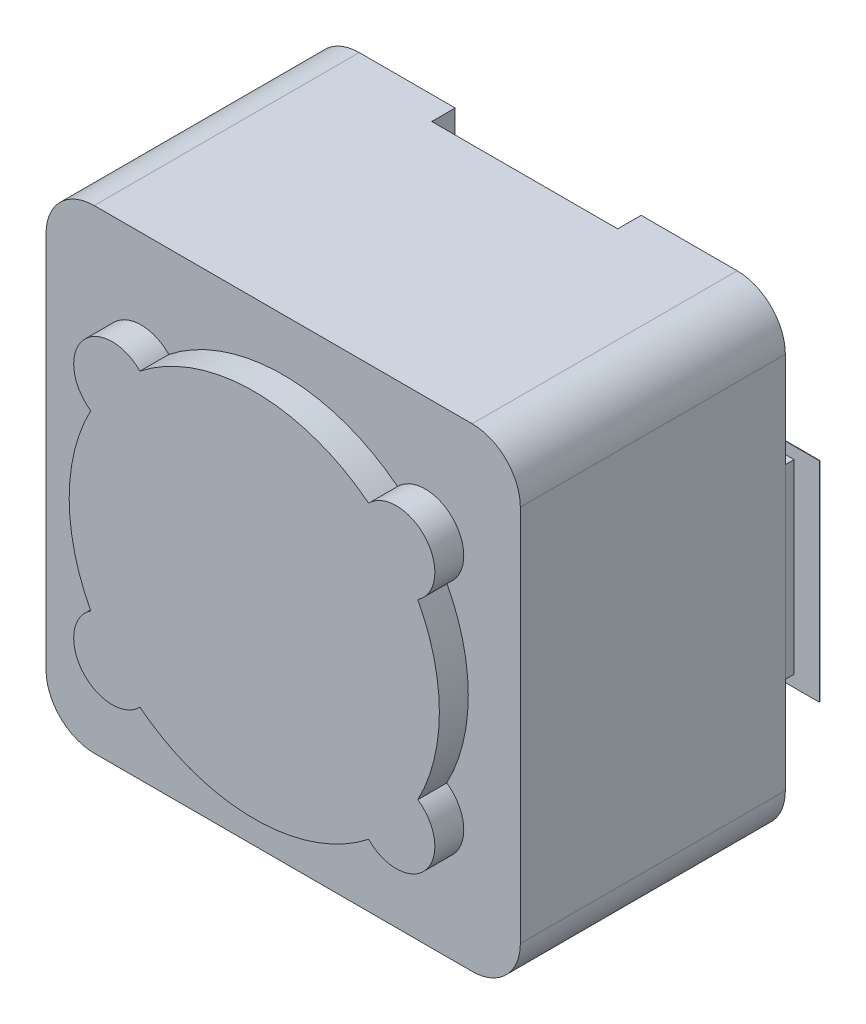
ISO-10303-21;
HEADER;
FILE_DESCRIPTION(('STEP AP214'),'2;1');
FILE_NAME('part.step','',(''),(''),'','','');
FILE_SCHEMA(('AUTOMOTIVE_DESIGN { 1 0 10303 214 1 1 1 1 }'));
ENDSEC;
DATA;
#1=APPLICATION_CONTEXT('core data for automotive mechanical design processes');
#2=APPLICATION_PROTOCOL_DEFINITION('international standard','automotive_design',2000,#1);
#3=PRODUCT_CONTEXT('',#1,'mechanical');
#4=PRODUCT('Part','Part','',(#3));
#5=PRODUCT_RELATED_PRODUCT_CATEGORY('part','',(#4));
#6=PRODUCT_DEFINITION_FORMATION('','',#4);
#7=PRODUCT_DEFINITION_CONTEXT('part definition',#1,'design');
#8=PRODUCT_DEFINITION('design','',#6,#7);
#9=PRODUCT_DEFINITION_SHAPE('','',#8);
#10=(LENGTH_UNIT() NAMED_UNIT(*) SI_UNIT(.MILLI.,.METRE.));
#11=(NAMED_UNIT(*) PLANE_ANGLE_UNIT() SI_UNIT($,.RADIAN.));
#12=(NAMED_UNIT(*) SI_UNIT($,.STERADIAN.) SOLID_ANGLE_UNIT());
#13=UNCERTAINTY_MEASURE_WITH_UNIT(LENGTH_MEASURE(1.E-05),#10,'distance_accuracy_value','');
#14=(GEOMETRIC_REPRESENTATION_CONTEXT(3) GLOBAL_UNCERTAINTY_ASSIGNED_CONTEXT((#13)) GLOBAL_UNIT_ASSIGNED_CONTEXT((#10,
#11,#12)) REPRESENTATION_CONTEXT('',''));
#15=CARTESIAN_POINT('',(0.,0.,0.));
#16=DIRECTION('',(0.,0.,1.));
#17=DIRECTION('',(1.,0.,0.));
#18=AXIS2_PLACEMENT_3D('',#15,#16,#17);
#19=CARTESIAN_POINT('',(-6.2500000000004,-6.2499999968,8.076184));
#20=DIRECTION('',(0.,0.,1.));
#21=DIRECTION('',(1.,0.,0.));
#22=AXIS2_PLACEMENT_3D('',#19,#20,#21);
#23=PLANE('',#22);
#24=CARTESIAN_POINT('',(0.,0.,8.076184));
#25=DIRECTION('',(0.,0.,1.));
#26=DIRECTION('',(1.,0.,0.));
#27=AXIS2_PLACEMENT_3D('',#24,#25,#26);
#28=CIRCLE('',#27,4.87790319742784);
#29=CARTESIAN_POINT('',(-4.30995957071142,-2.28433537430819,8.076184));
#30=VERTEX_POINT('',#29);
#31=CARTESIAN_POINT('',(-4.30995957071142,2.28433537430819,8.076184));
#32=VERTEX_POINT('',#31);
#33=EDGE_CURVE('E19',#30,#32,#28,.F.);
#34=ORIENTED_EDGE('',*,*,#33,.F.);
#35=CARTESIAN_POINT('',(-3.74326141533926,-3.12760828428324,8.076184));
#36=DIRECTION('',(0.,0.,1.));
#37=DIRECTION('',(1.,0.,0.));
#38=AXIS2_PLACEMENT_3D('',#35,#36,#37);
#39=CIRCLE('',#38,1.016);
#40=CARTESIAN_POINT('',(-3.0141687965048,-3.83519570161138,8.076184));
#41=VERTEX_POINT('',#40);
#42=EDGE_CURVE('E298',#41,#30,#39,.F.);
#43=ORIENTED_EDGE('',*,*,#42,.F.);
#44=CARTESIAN_POINT('',(0.,0.,8.076184));
#45=DIRECTION('',(0.,0.,1.));
#46=DIRECTION('',(1.,0.,0.));
#47=AXIS2_PLACEMENT_3D('',#44,#45,#46);
#48=CIRCLE('',#47,4.87790319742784);
#49=CARTESIAN_POINT('',(3.01416879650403,-3.83519570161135,8.076184));
#50=VERTEX_POINT('',#49);
#51=EDGE_CURVE('E314',#50,#41,#48,.F.);
#52=ORIENTED_EDGE('',*,*,#51,.F.);
#53=CARTESIAN_POINT('',(3.74326141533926,-3.12760828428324,8.076184));
#54=DIRECTION('',(0.,0.,1.));
#55=DIRECTION('',(1.,0.,0.));
#56=AXIS2_PLACEMENT_3D('',#53,#54,#55);
#57=CIRCLE('',#56,1.016);
#58=CARTESIAN_POINT('',(4.30995957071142,-2.28433537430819,8.076184));
#59=VERTEX_POINT('',#58);
#60=EDGE_CURVE('E327',#59,#50,#57,.F.);
#61=ORIENTED_EDGE('',*,*,#60,.F.);
#62=CARTESIAN_POINT('',(0.,0.,8.076184));
#63=DIRECTION('',(0.,0.,1.));
#64=DIRECTION('',(1.,0.,0.));
#65=AXIS2_PLACEMENT_3D('',#62,#63,#64);
#66=CIRCLE('',#65,4.87790319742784);
#67=CARTESIAN_POINT('',(4.30995957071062,2.28433537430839,8.076184));
#68=VERTEX_POINT('',#67);
#69=EDGE_CURVE('E330',#68,#59,#66,.F.);
#70=ORIENTED_EDGE('',*,*,#69,.F.);
#71=CARTESIAN_POINT('',(3.74326141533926,3.12760828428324,8.076184));
#72=DIRECTION('',(0.,0.,1.));
#73=DIRECTION('',(1.,0.,0.));
#74=AXIS2_PLACEMENT_3D('',#71,#72,#73);
#75=CIRCLE('',#74,1.016);
#76=CARTESIAN_POINT('',(3.0141687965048,3.83519570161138,8.076184));
#77=VERTEX_POINT('',#76);
#78=EDGE_CURVE('E333',#77,#68,#75,.F.);
#79=ORIENTED_EDGE('',*,*,#78,.F.);
#80=CARTESIAN_POINT('',(0.,0.,8.076184));
#81=DIRECTION('',(0.,0.,1.));
#82=DIRECTION('',(1.,0.,0.));
#83=AXIS2_PLACEMENT_3D('',#80,#81,#82);
#84=CIRCLE('',#83,4.87790319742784);
#85=CARTESIAN_POINT('',(-3.01416879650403,3.83519570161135,8.076184));
#86=VERTEX_POINT('',#85);
#87=EDGE_CURVE('E336',#86,#77,#84,.F.);
#88=ORIENTED_EDGE('',*,*,#87,.F.);
#89=CARTESIAN_POINT('',(-3.74326141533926,3.12760828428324,8.076184));
#90=DIRECTION('',(0.,0.,1.));
#91=DIRECTION('',(1.,0.,0.));
#92=AXIS2_PLACEMENT_3D('',#89,#90,#91);
#93=CIRCLE('',#92,1.016);
#94=EDGE_CURVE('E301',#32,#86,#93,.F.);
#95=ORIENTED_EDGE('',*,*,#94,.F.);
#96=EDGE_LOOP('',(#34,#43,#52,#61,#70,#79,#88,#95));
#97=FACE_BOUND('',#96,.T.);
#98=ADVANCED_FACE('F16',(#97),#23,.T.);
#99=CARTESIAN_POINT('',(0.,0.,0.0762));
#100=DIRECTION('',(0.,0.,1.));
#101=DIRECTION('',(1.,0.,0.));
#102=AXIS2_PLACEMENT_3D('',#99,#100,#101);
#103=PLANE('',#102);
#104=DIRECTION('',(1.,0.,0.));
#105=VECTOR('',#104,1.);
#106=CARTESIAN_POINT('',(6.9084952,2.7560016,0.0762));
#107=LINE('',#106,#105);
#108=CARTESIAN_POINT('',(6.9084952,2.7560016,0.0762));
#109=VERTEX_POINT('',#108);
#110=CARTESIAN_POINT('',(3.047492,2.7560016,0.0762));
#111=VERTEX_POINT('',#110);
#112=EDGE_CURVE('E476',#109,#111,#107,.F.);
#113=ORIENTED_EDGE('',*,*,#112,.F.);
#114=DIRECTION('',(0.,1.,0.));
#115=VECTOR('',#114,1.);
#116=CARTESIAN_POINT('',(6.9084952,-2.7560016,0.0762));
#117=LINE('',#116,#115);
#118=CARTESIAN_POINT('',(6.9084952,-2.7560016,0.0762));
#119=VERTEX_POINT('',#118);
#120=EDGE_CURVE('E317',#119,#109,#117,.T.);
#121=ORIENTED_EDGE('',*,*,#120,.F.);
#122=DIRECTION('',(1.,0.,0.));
#123=VECTOR('',#122,1.);
#124=CARTESIAN_POINT('',(3.047492,-2.7560016,0.0762));
#125=LINE('',#124,#123);
#126=CARTESIAN_POINT('',(3.047492,-2.7560016,0.0762));
#127=VERTEX_POINT('',#126);
#128=EDGE_CURVE('E462',#127,#119,#125,.T.);
#129=ORIENTED_EDGE('',*,*,#128,.F.);
#130=DIRECTION('',(0.,1.,0.));
#131=VECTOR('',#130,1.);
#132=CARTESIAN_POINT('',(3.047492,2.7560016,0.0762));
#133=LINE('',#132,#131);
#134=EDGE_CURVE('E471',#111,#127,#133,.F.);
#135=ORIENTED_EDGE('',*,*,#134,.F.);
#136=EDGE_LOOP('',(#113,#121,#129,#135));
#137=FACE_BOUND('',#136,.T.);
#138=ADVANCED_FACE('F907',(#137),#103,.F.);
#139=CARTESIAN_POINT('',(0.,0.,0.0762));
#140=DIRECTION('',(0.,0.,1.));
#141=DIRECTION('',(1.,0.,0.));
#142=AXIS2_PLACEMENT_3D('',#139,#140,#141);
#143=PLANE('',#142);
#144=DIRECTION('',(1.,0.,0.));
#145=VECTOR('',#144,1.);
#146=CARTESIAN_POINT('',(-3.047492,2.7560016,0.0762));
#147=LINE('',#146,#145);
#148=CARTESIAN_POINT('',(-3.047492,2.7560016,0.0762));
#149=VERTEX_POINT('',#148);
#150=CARTESIAN_POINT('',(-6.9084952,2.7560016,0.0762));
#151=VERTEX_POINT('',#150);
#152=EDGE_CURVE('E455',#149,#151,#147,.F.);
#153=ORIENTED_EDGE('',*,*,#152,.F.);
#154=DIRECTION('',(0.,1.,0.));
#155=VECTOR('',#154,1.);
#156=CARTESIAN_POINT('',(-3.047492,-2.7560016,0.0762));
#157=LINE('',#156,#155);
#158=CARTESIAN_POINT('',(-3.047492,-2.7560016,0.0762));
#159=VERTEX_POINT('',#158);
#160=EDGE_CURVE('E460',#159,#149,#157,.T.);
#161=ORIENTED_EDGE('',*,*,#160,.F.);
#162=DIRECTION('',(1.,0.,0.));
#163=VECTOR('',#162,1.);
#164=CARTESIAN_POINT('',(-6.9084952,-2.7560016,0.0762));
#165=LINE('',#164,#163);
#166=CARTESIAN_POINT('',(-6.9084952,-2.7560016,0.0762));
#167=VERTEX_POINT('',#166);
#168=EDGE_CURVE('E435',#167,#159,#165,.T.);
#169=ORIENTED_EDGE('',*,*,#168,.F.);
#170=DIRECTION('',(0.,1.,0.));
#171=VECTOR('',#170,1.);
#172=CARTESIAN_POINT('',(-6.9084952,2.7560016,0.0762));
#173=LINE('',#172,#171);
#174=EDGE_CURVE('E450',#151,#167,#173,.F.);
#175=ORIENTED_EDGE('',*,*,#174,.F.);
#176=EDGE_LOOP('',(#153,#161,#169,#175));
#177=FACE_BOUND('',#176,.T.);
#178=ADVANCED_FACE('F905',(#177),#143,.F.);
#179=CARTESIAN_POINT('',(0.,0.,8.076184));
#180=DIRECTION('',(0.,0.,1.));
#181=DIRECTION('',(1.,0.,0.));
#182=AXIS2_PLACEMENT_3D('',#179,#180,#181);
#183=CYLINDRICAL_SURFACE('',#182,4.87790319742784);
#184=DIRECTION('',(0.,0.,1.));
#185=VECTOR('',#184,1.);
#186=CARTESIAN_POINT('',(-4.30995957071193,-2.28433537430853,8.076184));
#187=LINE('',#186,#185);
#188=CARTESIAN_POINT('',(-4.30995957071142,-2.28433537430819,7.314184));
#189=VERTEX_POINT('',#188);
#190=EDGE_CURVE('E306',#30,#189,#187,.F.);
#191=ORIENTED_EDGE('',*,*,#190,.F.);
#192=ORIENTED_EDGE('',*,*,#33,.T.);
#193=DIRECTION('',(0.,0.,1.));
#194=VECTOR('',#193,1.);
#195=CARTESIAN_POINT('',(-4.30995957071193,2.28433537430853,8.076184));
#196=LINE('',#195,#194);
#197=CARTESIAN_POINT('',(-4.30995957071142,2.28433537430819,7.314184));
#198=VERTEX_POINT('',#197);
#199=EDGE_CURVE('E304',#198,#32,#196,.T.);
#200=ORIENTED_EDGE('',*,*,#199,.F.);
#201=CARTESIAN_POINT('',(0.,0.,7.314184));
#202=DIRECTION('',(0.,0.,1.));
#203=DIRECTION('',(1.,0.,0.));
#204=AXIS2_PLACEMENT_3D('',#201,#202,#203);
#205=CIRCLE('',#204,4.87790319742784);
#206=EDGE_CURVE('E309',#189,#198,#205,.F.);
#207=ORIENTED_EDGE('',*,*,#206,.F.);
#208=EDGE_LOOP('',(#191,#192,#200,#207));
#209=FACE_BOUND('',#208,.T.);
#210=ADVANCED_FACE('F307',(#209),#183,.T.);
#211=CARTESIAN_POINT('',(-3.74326141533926,3.12760828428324,8.076184));
#212=DIRECTION('',(0.,0.,1.));
#213=DIRECTION('',(1.,0.,0.));
#214=AXIS2_PLACEMENT_3D('',#211,#212,#213);
#215=CYLINDRICAL_SURFACE('',#214,1.016);
#216=ORIENTED_EDGE('',*,*,#199,.T.);
#217=ORIENTED_EDGE('',*,*,#94,.T.);
#218=DIRECTION('',(0.,0.,1.));
#219=VECTOR('',#218,1.);
#220=CARTESIAN_POINT('',(-3.01416879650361,3.83519570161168,8.076184));
#221=LINE('',#220,#219);
#222=CARTESIAN_POINT('',(-3.01416879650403,3.83519570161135,7.314184));
#223=VERTEX_POINT('',#222);
#224=EDGE_CURVE('E337',#223,#86,#221,.T.);
#225=ORIENTED_EDGE('',*,*,#224,.F.);
#226=CARTESIAN_POINT('',(-3.74326141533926,3.12760828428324,7.314184));
#227=DIRECTION('',(0.,0.,1.));
#228=DIRECTION('',(1.,0.,0.));
#229=AXIS2_PLACEMENT_3D('',#226,#227,#228);
#230=CIRCLE('',#229,1.016);
#231=EDGE_CURVE('E432',#198,#223,#230,.F.);
#232=ORIENTED_EDGE('',*,*,#231,.F.);
#233=EDGE_LOOP('',(#216,#217,#225,#232));
#234=FACE_BOUND('',#233,.T.);
#235=ADVANCED_FACE('F913',(#234),#215,.T.);
#236=CARTESIAN_POINT('',(0.,0.,8.076184));
#237=DIRECTION('',(0.,0.,1.));
#238=DIRECTION('',(1.,0.,0.));
#239=AXIS2_PLACEMENT_3D('',#236,#237,#238);
#240=CYLINDRICAL_SURFACE('',#239,4.87790319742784);
#241=ORIENTED_EDGE('',*,*,#224,.T.);
#242=ORIENTED_EDGE('',*,*,#87,.T.);
#243=DIRECTION('',(0.,0.,1.));
#244=VECTOR('',#243,1.);
#245=CARTESIAN_POINT('',(3.01416879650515,3.83519570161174,8.076184));
#246=LINE('',#245,#244);
#247=CARTESIAN_POINT('',(3.0141687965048,3.83519570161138,7.314184));
#248=VERTEX_POINT('',#247);
#249=EDGE_CURVE('E335',#248,#77,#246,.T.);
#250=ORIENTED_EDGE('',*,*,#249,.F.);
#251=CARTESIAN_POINT('',(0.,0.,7.314184));
#252=DIRECTION('',(0.,0.,1.));
#253=DIRECTION('',(1.,0.,0.));
#254=AXIS2_PLACEMENT_3D('',#251,#252,#253);
#255=CIRCLE('',#254,4.87790319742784);
#256=EDGE_CURVE('E430',#223,#248,#255,.F.);
#257=ORIENTED_EDGE('',*,*,#256,.F.);
#258=EDGE_LOOP('',(#241,#242,#250,#257));
#259=FACE_BOUND('',#258,.T.);
#260=ADVANCED_FACE('F493',(#259),#240,.T.);
#261=CARTESIAN_POINT('',(3.74326141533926,3.12760828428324,8.076184));
#262=DIRECTION('',(0.,0.,1.));
#263=DIRECTION('',(1.,0.,0.));
#264=AXIS2_PLACEMENT_3D('',#261,#262,#263);
#265=CYLINDRICAL_SURFACE('',#264,1.016);
#266=ORIENTED_EDGE('',*,*,#249,.T.);
#267=ORIENTED_EDGE('',*,*,#78,.T.);
#268=DIRECTION('',(0.,0.,1.));
#269=VECTOR('',#268,1.);
#270=CARTESIAN_POINT('',(4.30995957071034,2.28433537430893,8.076184));
#271=LINE('',#270,#269);
#272=CARTESIAN_POINT('',(4.30995957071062,2.28433537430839,7.314184));
#273=VERTEX_POINT('',#272);
#274=EDGE_CURVE('E332',#273,#68,#271,.T.);
#275=ORIENTED_EDGE('',*,*,#274,.F.);
#276=CARTESIAN_POINT('',(3.74326141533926,3.12760828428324,7.314184));
#277=DIRECTION('',(0.,0.,1.));
#278=DIRECTION('',(1.,0.,0.));
#279=AXIS2_PLACEMENT_3D('',#276,#277,#278);
#280=CIRCLE('',#279,1.016);
#281=EDGE_CURVE('E427',#248,#273,#280,.F.);
#282=ORIENTED_EDGE('',*,*,#281,.F.);
#283=EDGE_LOOP('',(#266,#267,#275,#282));
#284=FACE_BOUND('',#283,.T.);
#285=ADVANCED_FACE('F488',(#284),#265,.T.);
#286=CARTESIAN_POINT('',(0.,0.,8.076184));
#287=DIRECTION('',(0.,0.,1.));
#288=DIRECTION('',(1.,0.,0.));
#289=AXIS2_PLACEMENT_3D('',#286,#287,#288);
#290=CYLINDRICAL_SURFACE('',#289,4.87790319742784);
#291=ORIENTED_EDGE('',*,*,#274,.T.);
#292=ORIENTED_EDGE('',*,*,#69,.T.);
#293=DIRECTION('',(0.,0.,1.));
#294=VECTOR('',#293,1.);
#295=CARTESIAN_POINT('',(4.30995957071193,-2.28433537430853,8.076184));
#296=LINE('',#295,#294);
#297=CARTESIAN_POINT('',(4.30995957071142,-2.28433537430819,7.314184));
#298=VERTEX_POINT('',#297);
#299=EDGE_CURVE('E329',#298,#59,#296,.T.);
#300=ORIENTED_EDGE('',*,*,#299,.F.);
#301=CARTESIAN_POINT('',(0.,0.,7.314184));
#302=DIRECTION('',(0.,0.,1.));
#303=DIRECTION('',(1.,0.,0.));
#304=AXIS2_PLACEMENT_3D('',#301,#302,#303);
#305=CIRCLE('',#304,4.87790319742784);
#306=EDGE_CURVE('E424',#273,#298,#305,.F.);
#307=ORIENTED_EDGE('',*,*,#306,.F.);
#308=EDGE_LOOP('',(#291,#292,#300,#307));
#309=FACE_BOUND('',#308,.T.);
#310=ADVANCED_FACE('F497',(#309),#290,.T.);
#311=CARTESIAN_POINT('',(3.74326141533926,-3.12760828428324,8.076184));
#312=DIRECTION('',(0.,0.,1.));
#313=DIRECTION('',(1.,0.,0.));
#314=AXIS2_PLACEMENT_3D('',#311,#312,#313);
#315=CYLINDRICAL_SURFACE('',#314,1.016);
#316=ORIENTED_EDGE('',*,*,#299,.T.);
#317=ORIENTED_EDGE('',*,*,#60,.T.);
#318=DIRECTION('',(0.,0.,1.));
#319=VECTOR('',#318,1.);
#320=CARTESIAN_POINT('',(3.01416879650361,-3.83519570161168,8.076184));
#321=LINE('',#320,#319);
#322=CARTESIAN_POINT('',(3.01416879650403,-3.83519570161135,7.314184));
#323=VERTEX_POINT('',#322);
#324=EDGE_CURVE('E326',#323,#50,#321,.T.);
#325=ORIENTED_EDGE('',*,*,#324,.F.);
#326=CARTESIAN_POINT('',(3.74326141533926,-3.12760828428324,7.314184));
#327=DIRECTION('',(0.,0.,1.));
#328=DIRECTION('',(1.,0.,0.));
#329=AXIS2_PLACEMENT_3D('',#326,#327,#328);
#330=CIRCLE('',#329,1.016);
#331=EDGE_CURVE('E421',#298,#323,#330,.F.);
#332=ORIENTED_EDGE('',*,*,#331,.F.);
#333=EDGE_LOOP('',(#316,#317,#325,#332));
#334=FACE_BOUND('',#333,.T.);
#335=ADVANCED_FACE('F925',(#334),#315,.T.);
#336=CARTESIAN_POINT('',(0.,0.,8.076184));
#337=DIRECTION('',(0.,0.,1.));
#338=DIRECTION('',(1.,0.,0.));
#339=AXIS2_PLACEMENT_3D('',#336,#337,#338);
#340=CYLINDRICAL_SURFACE('',#339,4.87790319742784);
#341=ORIENTED_EDGE('',*,*,#324,.T.);
#342=ORIENTED_EDGE('',*,*,#51,.T.);
#343=DIRECTION('',(0.,0.,1.));
#344=VECTOR('',#343,1.);
#345=CARTESIAN_POINT('',(-3.01416879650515,-3.83519570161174,8.076184));
#346=LINE('',#345,#344);
#347=CARTESIAN_POINT('',(-3.0141687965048,-3.83519570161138,7.314184));
#348=VERTEX_POINT('',#347);
#349=EDGE_CURVE('E313',#348,#41,#346,.T.);
#350=ORIENTED_EDGE('',*,*,#349,.F.);
#351=CARTESIAN_POINT('',(0.,0.,7.314184));
#352=DIRECTION('',(0.,0.,1.));
#353=DIRECTION('',(1.,0.,0.));
#354=AXIS2_PLACEMENT_3D('',#351,#352,#353);
#355=CIRCLE('',#354,4.87790319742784);
#356=EDGE_CURVE('E418',#323,#348,#355,.F.);
#357=ORIENTED_EDGE('',*,*,#356,.F.);
#358=EDGE_LOOP('',(#341,#342,#350,#357));
#359=FACE_BOUND('',#358,.T.);
#360=ADVANCED_FACE('F928',(#359),#340,.T.);
#361=CARTESIAN_POINT('',(-3.74326141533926,-3.12760828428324,8.076184));
#362=DIRECTION('',(0.,0.,1.));
#363=DIRECTION('',(1.,0.,0.));
#364=AXIS2_PLACEMENT_3D('',#361,#362,#363);
#365=CYLINDRICAL_SURFACE('',#364,1.016);
#366=ORIENTED_EDGE('',*,*,#349,.T.);
#367=ORIENTED_EDGE('',*,*,#42,.T.);
#368=ORIENTED_EDGE('',*,*,#190,.T.);
#369=CARTESIAN_POINT('',(-3.74326141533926,-3.12760828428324,7.314184));
#370=DIRECTION('',(0.,0.,1.));
#371=DIRECTION('',(1.,0.,0.));
#372=AXIS2_PLACEMENT_3D('',#369,#370,#371);
#373=CIRCLE('',#372,1.016);
#374=EDGE_CURVE('E415',#348,#189,#373,.F.);
#375=ORIENTED_EDGE('',*,*,#374,.F.);
#376=EDGE_LOOP('',(#366,#367,#368,#375));
#377=FACE_BOUND('',#376,.T.);
#378=ADVANCED_FACE('F316',(#377),#365,.T.);
#379=CARTESIAN_POINT('',(6.9084952,-2.7560016,0.0762));
#380=DIRECTION('',(1.,0.,0.));
#381=DIRECTION('',(0.,0.,-1.));
#382=AXIS2_PLACEMENT_3D('',#379,#380,#381);
#383=PLANE('',#382);
#384=DIRECTION('',(0.,0.,-1.));
#385=VECTOR('',#384,1.);
#386=CARTESIAN_POINT('',(6.9084952,-2.7560016,0.0762));
#387=LINE('',#386,#385);
#388=CARTESIAN_POINT('',(6.9084952,-2.7560016,0.0889));
#389=VERTEX_POINT('',#388);
#390=EDGE_CURVE('E468',#119,#389,#387,.F.);
#391=ORIENTED_EDGE('',*,*,#390,.F.);
#392=ORIENTED_EDGE('',*,*,#120,.T.);
#393=DIRECTION('',(0.,0.,1.));
#394=VECTOR('',#393,1.);
#395=CARTESIAN_POINT('',(6.9084952,2.7560016,0.0762));
#396=LINE('',#395,#394);
#397=CARTESIAN_POINT('',(6.9084952,2.7560016,0.0889));
#398=VERTEX_POINT('',#397);
#399=EDGE_CURVE('E319',#398,#109,#396,.F.);
#400=ORIENTED_EDGE('',*,*,#399,.F.);
#401=DIRECTION('',(0.,1.,0.));
#402=VECTOR('',#401,1.);
#403=CARTESIAN_POINT('',(6.9084952,0.,0.0889));
#404=LINE('',#403,#402);
#405=EDGE_CURVE('E417',#389,#398,#404,.T.);
#406=ORIENTED_EDGE('',*,*,#405,.F.);
#407=EDGE_LOOP('',(#391,#392,#400,#406));
#408=FACE_BOUND('',#407,.T.);
#409=ADVANCED_FACE('F935',(#408),#383,.T.);
#410=CARTESIAN_POINT('',(6.9084952,2.7560016,0.0762));
#411=DIRECTION('',(0.,1.,0.));
#412=DIRECTION('',(0.,0.,1.));
#413=AXIS2_PLACEMENT_3D('',#410,#411,#412);
#414=PLANE('',#413);
#415=ORIENTED_EDGE('',*,*,#399,.T.);
#416=ORIENTED_EDGE('',*,*,#112,.T.);
#417=DIRECTION('',(0.,0.,1.));
#418=VECTOR('',#417,1.);
#419=CARTESIAN_POINT('',(3.047492,2.7560016,0.0762));
#420=LINE('',#419,#418);
#421=CARTESIAN_POINT('',(3.047492,2.7560016,0.0889));
#422=VERTEX_POINT('',#421);
#423=EDGE_CURVE('E473',#422,#111,#420,.F.);
#424=ORIENTED_EDGE('',*,*,#423,.F.);
#425=DIRECTION('',(1.,0.,0.));
#426=VECTOR('',#425,1.);
#427=CARTESIAN_POINT('',(0.,2.7560016,0.0889));
#428=LINE('',#427,#426);
#429=EDGE_CURVE('E579',#398,#422,#428,.F.);
#430=ORIENTED_EDGE('',*,*,#429,.F.);
#431=EDGE_LOOP('',(#415,#416,#424,#430));
#432=FACE_BOUND('',#431,.T.);
#433=ADVANCED_FACE('F938',(#432),#414,.T.);
#434=CARTESIAN_POINT('',(3.047492,2.7560016,0.0762));
#435=DIRECTION('',(-1.,0.,0.));
#436=DIRECTION('',(0.,0.,1.));
#437=AXIS2_PLACEMENT_3D('',#434,#435,#436);
#438=PLANE('',#437);
#439=ORIENTED_EDGE('',*,*,#423,.T.);
#440=ORIENTED_EDGE('',*,*,#134,.T.);
#441=DIRECTION('',(0.,0.,-1.));
#442=VECTOR('',#441,1.);
#443=CARTESIAN_POINT('',(3.047492,-2.7560016,0.0762));
#444=LINE('',#443,#442);
#445=CARTESIAN_POINT('',(3.047492,-2.7560016,0.0889));
#446=VERTEX_POINT('',#445);
#447=EDGE_CURVE('E465',#446,#127,#444,.T.);
#448=ORIENTED_EDGE('',*,*,#447,.F.);
#449=DIRECTION('',(0.,1.,0.));
#450=VECTOR('',#449,1.);
#451=CARTESIAN_POINT('',(3.047492,0.,0.0889));
#452=LINE('',#451,#450);
#453=EDGE_CURVE('E576',#422,#446,#452,.F.);
#454=ORIENTED_EDGE('',*,*,#453,.F.);
#455=EDGE_LOOP('',(#439,#440,#448,#454));
#456=FACE_BOUND('',#455,.T.);
#457=ADVANCED_FACE('F942',(#456),#438,.T.);
#458=CARTESIAN_POINT('',(3.047492,-2.7560016,0.0762));
#459=DIRECTION('',(0.,-1.,0.));
#460=DIRECTION('',(0.,0.,-1.));
#461=AXIS2_PLACEMENT_3D('',#458,#459,#460);
#462=PLANE('',#461);
#463=ORIENTED_EDGE('',*,*,#447,.T.);
#464=ORIENTED_EDGE('',*,*,#128,.T.);
#465=ORIENTED_EDGE('',*,*,#390,.T.);
#466=DIRECTION('',(1.,0.,0.));
#467=VECTOR('',#466,1.);
#468=CARTESIAN_POINT('',(0.,-2.7560016,0.0889));
#469=LINE('',#468,#467);
#470=EDGE_CURVE('E573',#446,#389,#469,.T.);
#471=ORIENTED_EDGE('',*,*,#470,.F.);
#472=EDGE_LOOP('',(#463,#464,#465,#471));
#473=FACE_BOUND('',#472,.T.);
#474=ADVANCED_FACE('F946',(#473),#462,.T.);
#475=CARTESIAN_POINT('',(-3.047492,-2.7560016,0.0762));
#476=DIRECTION('',(1.,0.,0.));
#477=DIRECTION('',(0.,0.,-1.));
#478=AXIS2_PLACEMENT_3D('',#475,#476,#477);
#479=PLANE('',#478);
#480=DIRECTION('',(0.,0.,-1.));
#481=VECTOR('',#480,1.);
#482=CARTESIAN_POINT('',(-3.047492,-2.7560016,0.0762));
#483=LINE('',#482,#481);
#484=CARTESIAN_POINT('',(-3.047492,-2.7560016,0.0889));
#485=VERTEX_POINT('',#484);
#486=EDGE_CURVE('E443',#159,#485,#483,.F.);
#487=ORIENTED_EDGE('',*,*,#486,.F.);
#488=ORIENTED_EDGE('',*,*,#160,.T.);
#489=DIRECTION('',(0.,0.,1.));
#490=VECTOR('',#489,1.);
#491=CARTESIAN_POINT('',(-3.047492,2.7560016,0.0762));
#492=LINE('',#491,#490);
#493=CARTESIAN_POINT('',(-3.047492,2.7560016,0.0889));
#494=VERTEX_POINT('',#493);
#495=EDGE_CURVE('E457',#494,#149,#492,.F.);
#496=ORIENTED_EDGE('',*,*,#495,.F.);
#497=DIRECTION('',(0.,1.,0.));
#498=VECTOR('',#497,1.);
#499=CARTESIAN_POINT('',(-3.047492,0.,0.0889));
#500=LINE('',#499,#498);
#501=EDGE_CURVE('E570',#485,#494,#500,.T.);
#502=ORIENTED_EDGE('',*,*,#501,.F.);
#503=EDGE_LOOP('',(#487,#488,#496,#502));
#504=FACE_BOUND('',#503,.T.);
#505=ADVANCED_FACE('F900',(#504),#479,.T.);
#506=CARTESIAN_POINT('',(-3.047492,2.7560016,0.0762));
#507=DIRECTION('',(0.,1.,0.));
#508=DIRECTION('',(0.,0.,1.));
#509=AXIS2_PLACEMENT_3D('',#506,#507,#508);
#510=PLANE('',#509);
#511=ORIENTED_EDGE('',*,*,#495,.T.);
#512=ORIENTED_EDGE('',*,*,#152,.T.);
#513=DIRECTION('',(0.,0.,1.));
#514=VECTOR('',#513,1.);
#515=CARTESIAN_POINT('',(-6.9084952,2.7560016,0.0762));
#516=LINE('',#515,#514);
#517=CARTESIAN_POINT('',(-6.9084952,2.7560016,0.0889));
#518=VERTEX_POINT('',#517);
#519=EDGE_CURVE('E452',#518,#151,#516,.F.);
#520=ORIENTED_EDGE('',*,*,#519,.F.);
#521=DIRECTION('',(1.,0.,0.));
#522=VECTOR('',#521,1.);
#523=CARTESIAN_POINT('',(0.,2.7560016,0.0889));
#524=LINE('',#523,#522);
#525=EDGE_CURVE('E567',#494,#518,#524,.F.);
#526=ORIENTED_EDGE('',*,*,#525,.F.);
#527=EDGE_LOOP('',(#511,#512,#520,#526));
#528=FACE_BOUND('',#527,.T.);
#529=ADVANCED_FACE('F903',(#528),#510,.T.);
#530=CARTESIAN_POINT('',(-6.9084952,2.7560016,0.0762));
#531=DIRECTION('',(-1.,0.,0.));
#532=DIRECTION('',(0.,0.,1.));
#533=AXIS2_PLACEMENT_3D('',#530,#531,#532);
#534=PLANE('',#533);
#535=ORIENTED_EDGE('',*,*,#519,.T.);
#536=ORIENTED_EDGE('',*,*,#174,.T.);
#537=DIRECTION('',(0.,0.,-1.));
#538=VECTOR('',#537,1.);
#539=CARTESIAN_POINT('',(-6.9084952,-2.7560016,0.0762));
#540=LINE('',#539,#538);
#541=CARTESIAN_POINT('',(-6.9084952,-2.7560016,0.0889));
#542=VERTEX_POINT('',#541);
#543=EDGE_CURVE('E437',#542,#167,#540,.T.);
#544=ORIENTED_EDGE('',*,*,#543,.F.);
#545=DIRECTION('',(0.,1.,0.));
#546=VECTOR('',#545,1.);
#547=CARTESIAN_POINT('',(-6.9084952,0.,0.0889));
#548=LINE('',#547,#546);
#549=EDGE_CURVE('E564',#518,#542,#548,.F.);
#550=ORIENTED_EDGE('',*,*,#549,.F.);
#551=EDGE_LOOP('',(#535,#536,#544,#550));
#552=FACE_BOUND('',#551,.T.);
#553=ADVANCED_FACE('F896',(#552),#534,.T.);
#554=CARTESIAN_POINT('',(-6.9084952,-2.7560016,0.0762));
#555=DIRECTION('',(0.,-1.,0.));
#556=DIRECTION('',(0.,0.,-1.));
#557=AXIS2_PLACEMENT_3D('',#554,#555,#556);
#558=PLANE('',#557);
#559=ORIENTED_EDGE('',*,*,#543,.T.);
#560=ORIENTED_EDGE('',*,*,#168,.T.);
#561=ORIENTED_EDGE('',*,*,#486,.T.);
#562=DIRECTION('',(1.,0.,0.));
#563=VECTOR('',#562,1.);
#564=CARTESIAN_POINT('',(0.,-2.7560016,0.0889));
#565=LINE('',#564,#563);
#566=EDGE_CURVE('E561',#542,#485,#565,.T.);
#567=ORIENTED_EDGE('',*,*,#566,.F.);
#568=EDGE_LOOP('',(#559,#560,#561,#567));
#569=FACE_BOUND('',#568,.T.);
#570=ADVANCED_FACE('F755',(#569),#558,.T.);
#571=CARTESIAN_POINT('',(-2.4500000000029,6.2499999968,0.948365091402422));
#572=DIRECTION('',(0.,0.,1.));
#573=DIRECTION('',(1.,0.,0.));
#574=AXIS2_PLACEMENT_3D('',#571,#572,#573);
#575=PLANE('',#574);
#576=DIRECTION('',(1.,0.,0.));
#577=VECTOR('',#576,1.);
#578=CARTESIAN_POINT('',(0.,6.2499999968,0.948365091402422));
#579=LINE('',#578,#577);
#580=CARTESIAN_POINT('',(2.4500000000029,6.2499999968,0.948365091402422));
#581=VERTEX_POINT('',#580);
#582=CARTESIAN_POINT('',(-2.4500000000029,6.2499999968,0.948365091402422));
#583=VERTEX_POINT('',#582);
#584=EDGE_CURVE('E549',#581,#583,#579,.F.);
#585=ORIENTED_EDGE('',*,*,#584,.F.);
#586=DIRECTION('',(0.,1.,0.));
#587=VECTOR('',#586,1.);
#588=CARTESIAN_POINT('',(2.4500000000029,6.2499999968,0.948365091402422));
#589=LINE('',#588,#587);
#590=CARTESIAN_POINT('',(2.4500000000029,4.23608427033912,0.948365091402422));
#591=VERTEX_POINT('',#590);
#592=EDGE_CURVE('E555',#581,#591,#589,.F.);
#593=ORIENTED_EDGE('',*,*,#592,.T.);
#594=CARTESIAN_POINT('',(0.,-0.0355302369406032,0.948365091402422));
#595=DIRECTION('',(0.,0.,-1.));
#596=DIRECTION('',(-1.,0.,0.));
#597=AXIS2_PLACEMENT_3D('',#594,#595,#596);
#598=CIRCLE('',#597,4.92434670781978);
#599=CARTESIAN_POINT('',(-2.45000000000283,4.23608427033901,0.948365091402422));
#600=VERTEX_POINT('',#599);
#601=EDGE_CURVE('E411',#600,#591,#598,.T.);
#602=ORIENTED_EDGE('',*,*,#601,.F.);
#603=DIRECTION('',(0.,1.,0.));
#604=VECTOR('',#603,1.);
#605=CARTESIAN_POINT('',(-2.4500000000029,6.2499999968,0.948365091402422));
#606=LINE('',#605,#604);
#607=EDGE_CURVE('E414',#600,#583,#606,.T.);
#608=ORIENTED_EDGE('',*,*,#607,.T.);
#609=EDGE_LOOP('',(#585,#593,#602,#608));
#610=FACE_BOUND('',#609,.T.);
#611=ADVANCED_FACE('F615',(#610),#575,.F.);
#612=CARTESIAN_POINT('',(-2.4500000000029,6.2499999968,0.948365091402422));
#613=DIRECTION('',(0.,0.,1.));
#614=DIRECTION('',(1.,0.,0.));
#615=AXIS2_PLACEMENT_3D('',#612,#613,#614);
#616=PLANE('',#615);
#617=DIRECTION('',(1.,0.,0.));
#618=VECTOR('',#617,1.);
#619=CARTESIAN_POINT('',(0.,-6.2499999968,0.948365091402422));
#620=LINE('',#619,#618);
#621=CARTESIAN_POINT('',(2.4500000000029,-6.2499999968,0.948365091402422));
#622=VERTEX_POINT('',#621);
#623=CARTESIAN_POINT('',(-2.4500000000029,-6.2499999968,0.948365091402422));
#624=VERTEX_POINT('',#623);
#625=EDGE_CURVE('E520',#622,#624,#620,.F.);
#626=ORIENTED_EDGE('',*,*,#625,.T.);
#627=DIRECTION('',(0.,1.,0.));
#628=VECTOR('',#627,1.);
#629=CARTESIAN_POINT('',(-2.4500000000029,6.2499999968,0.948365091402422));
#630=LINE('',#629,#628);
#631=CARTESIAN_POINT('',(-2.4500000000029,-4.30714474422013,0.948365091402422));
#632=VERTEX_POINT('',#631);
#633=EDGE_CURVE('E528',#624,#632,#630,.T.);
#634=ORIENTED_EDGE('',*,*,#633,.T.);
#635=CARTESIAN_POINT('',(0.,-0.0355302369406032,0.948365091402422));
#636=DIRECTION('',(0.,0.,-1.));
#637=DIRECTION('',(-1.,0.,0.));
#638=AXIS2_PLACEMENT_3D('',#635,#636,#637);
#639=CIRCLE('',#638,4.92434670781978);
#640=CARTESIAN_POINT('',(2.45000000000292,-4.30714474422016,0.948365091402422));
#641=VERTEX_POINT('',#640);
#642=EDGE_CURVE('E397',#641,#632,#639,.T.);
#643=ORIENTED_EDGE('',*,*,#642,.F.);
#644=DIRECTION('',(0.,1.,0.));
#645=VECTOR('',#644,1.);
#646=CARTESIAN_POINT('',(2.4500000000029,6.2499999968,0.948365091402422));
#647=LINE('',#646,#645);
#648=EDGE_CURVE('E531',#641,#622,#647,.F.);
#649=ORIENTED_EDGE('',*,*,#648,.T.);
#650=EDGE_LOOP('',(#626,#634,#643,#649));
#651=FACE_BOUND('',#650,.T.);
#652=ADVANCED_FACE('F504',(#651),#616,.F.);
#653=CARTESIAN_POINT('',(0.,-6.2499999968,7.314184));
#654=DIRECTION('',(0.,0.,1.));
#655=DIRECTION('',(1.,0.,0.));
#656=AXIS2_PLACEMENT_3D('',#653,#654,#655);
#657=PLANE('',#656);
#658=ORIENTED_EDGE('',*,*,#356,.T.);
#659=ORIENTED_EDGE('',*,*,#374,.T.);
#660=ORIENTED_EDGE('',*,*,#206,.T.);
#661=ORIENTED_EDGE('',*,*,#231,.T.);
#662=ORIENTED_EDGE('',*,*,#256,.T.);
#663=ORIENTED_EDGE('',*,*,#281,.T.);
#664=ORIENTED_EDGE('',*,*,#306,.T.);
#665=ORIENTED_EDGE('',*,*,#331,.T.);
#666=EDGE_LOOP('',(#658,#659,#660,#661,#662,#663,#664,#665));
#667=FACE_BOUND('',#666,.T.);
#668=CARTESIAN_POINT('',(-4.9800000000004,-4.9799999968,7.314184));
#669=DIRECTION('',(0.,0.,-1.));
#670=DIRECTION('',(-1.,0.,0.));
#671=AXIS2_PLACEMENT_3D('',#668,#669,#670);
#672=CIRCLE('',#671,1.27);
#673=CARTESIAN_POINT('',(-4.9800000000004,-6.2499999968,7.314184));
#674=VERTEX_POINT('',#673);
#675=CARTESIAN_POINT('',(-6.2500000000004,-4.9799999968,7.314184));
#676=VERTEX_POINT('',#675);
#677=EDGE_CURVE('E393',#674,#676,#672,.T.);
#678=ORIENTED_EDGE('',*,*,#677,.F.);
#679=DIRECTION('',(1.,0.,0.));
#680=VECTOR('',#679,1.);
#681=CARTESIAN_POINT('',(0.,-6.2499999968,7.314184));
#682=LINE('',#681,#680);
#683=CARTESIAN_POINT('',(4.9800000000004,-6.2499999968,7.314184));
#684=VERTEX_POINT('',#683);
#685=EDGE_CURVE('E509',#674,#684,#682,.T.);
#686=ORIENTED_EDGE('',*,*,#685,.T.);
#687=CARTESIAN_POINT('',(4.9800000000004,-4.9799999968,7.314184));
#688=DIRECTION('',(0.,0.,1.));
#689=DIRECTION('',(1.,0.,0.));
#690=AXIS2_PLACEMENT_3D('',#687,#688,#689);
#691=CIRCLE('',#690,1.27);
#692=CARTESIAN_POINT('',(6.2500000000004,-4.9799999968,7.314184));
#693=VERTEX_POINT('',#692);
#694=EDGE_CURVE('E401',#693,#684,#691,.F.);
#695=ORIENTED_EDGE('',*,*,#694,.F.);
#696=DIRECTION('',(0.,1.,0.));
#697=VECTOR('',#696,1.);
#698=CARTESIAN_POINT('',(6.2500000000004,-6.2499999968,7.314184));
#699=LINE('',#698,#697);
#700=CARTESIAN_POINT('',(6.2500000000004,4.9799999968,7.314184));
#701=VERTEX_POINT('',#700);
#702=EDGE_CURVE('E409',#701,#693,#699,.F.);
#703=ORIENTED_EDGE('',*,*,#702,.F.);
#704=CARTESIAN_POINT('',(4.9800000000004,4.9799999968,7.314184));
#705=DIRECTION('',(0.,0.,-1.));
#706=DIRECTION('',(-1.,0.,0.));
#707=AXIS2_PLACEMENT_3D('',#704,#705,#706);
#708=CIRCLE('',#707,1.27);
#709=CARTESIAN_POINT('',(4.9800000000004,6.2499999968,7.314184));
#710=VERTEX_POINT('',#709);
#711=EDGE_CURVE('E406',#710,#701,#708,.T.);
#712=ORIENTED_EDGE('',*,*,#711,.F.);
#713=DIRECTION('',(1.,0.,0.));
#714=VECTOR('',#713,1.);
#715=CARTESIAN_POINT('',(0.,6.2499999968,7.314184));
#716=LINE('',#715,#714);
#717=CARTESIAN_POINT('',(-4.9800000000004,6.2499999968,7.314184));
#718=VERTEX_POINT('',#717);
#719=EDGE_CURVE('E550',#718,#710,#716,.T.);
#720=ORIENTED_EDGE('',*,*,#719,.F.);
#721=CARTESIAN_POINT('',(-4.9800000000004,4.9799999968,7.314184));
#722=DIRECTION('',(0.,0.,1.));
#723=DIRECTION('',(1.,0.,0.));
#724=AXIS2_PLACEMENT_3D('',#721,#722,#723);
#725=CIRCLE('',#724,1.27);
#726=CARTESIAN_POINT('',(-6.2500000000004,4.9799999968,7.314184));
#727=VERTEX_POINT('',#726);
#728=EDGE_CURVE('E388',#727,#718,#725,.F.);
#729=ORIENTED_EDGE('',*,*,#728,.F.);
#730=DIRECTION('',(0.,1.,0.));
#731=VECTOR('',#730,1.);
#732=CARTESIAN_POINT('',(-6.2500000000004,-6.2499999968,7.314184));
#733=LINE('',#732,#731);
#734=EDGE_CURVE('E392',#676,#727,#733,.T.);
#735=ORIENTED_EDGE('',*,*,#734,.F.);
#736=EDGE_LOOP('',(#678,#686,#695,#703,#712,#720,#729,#735));
#737=FACE_BOUND('',#736,.T.);
#738=ADVANCED_FACE('F499',(#667,#737),#657,.T.);
#739=CARTESIAN_POINT('',(-2.4500000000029,6.2499999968,0.948365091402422));
#740=DIRECTION('',(0.,0.,1.));
#741=DIRECTION('',(1.,0.,0.));
#742=AXIS2_PLACEMENT_3D('',#739,#740,#741);
#743=PLANE('',#742);
#744=CARTESIAN_POINT('',(0.,-0.0355302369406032,0.948365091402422));
#745=DIRECTION('',(0.,0.,-1.));
#746=DIRECTION('',(-1.,0.,0.));
#747=AXIS2_PLACEMENT_3D('',#744,#745,#746);
#748=CIRCLE('',#747,3.96866028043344);
#749=CARTESIAN_POINT('',(2.4500000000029,-3.15767123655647,0.948365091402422));
#750=VERTEX_POINT('',#749);
#751=CARTESIAN_POINT('',(-2.4500000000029,-3.15767123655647,0.948365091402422));
#752=VERTEX_POINT('',#751);
#753=EDGE_CURVE('E384',#750,#752,#748,.T.);
#754=ORIENTED_EDGE('',*,*,#753,.T.);
#755=DIRECTION('',(0.,1.,0.));
#756=VECTOR('',#755,1.);
#757=CARTESIAN_POINT('',(-2.4500000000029,6.2499999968,0.948365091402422));
#758=LINE('',#757,#756);
#759=CARTESIAN_POINT('',(-2.4500000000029,3.08661076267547,0.948365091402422));
#760=VERTEX_POINT('',#759);
#761=EDGE_CURVE('E584',#752,#760,#758,.T.);
#762=ORIENTED_EDGE('',*,*,#761,.T.);
#763=CARTESIAN_POINT('',(0.,-0.0355302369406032,0.948365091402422));
#764=DIRECTION('',(0.,0.,-1.));
#765=DIRECTION('',(-1.,0.,0.));
#766=AXIS2_PLACEMENT_3D('',#763,#764,#765);
#767=CIRCLE('',#766,3.96866028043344);
#768=CARTESIAN_POINT('',(2.45000000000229,3.08661076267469,0.948365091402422));
#769=VERTEX_POINT('',#768);
#770=EDGE_CURVE('E380',#760,#769,#767,.T.);
#771=ORIENTED_EDGE('',*,*,#770,.T.);
#772=DIRECTION('',(0.,1.,0.));
#773=VECTOR('',#772,1.);
#774=CARTESIAN_POINT('',(2.4500000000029,6.2499999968,0.948365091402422));
#775=LINE('',#774,#773);
#776=EDGE_CURVE('E386',#769,#750,#775,.F.);
#777=ORIENTED_EDGE('',*,*,#776,.T.);
#778=EDGE_LOOP('',(#754,#762,#771,#777));
#779=FACE_BOUND('',#778,.T.);
#780=ADVANCED_FACE('F503',(#779),#743,.F.);
#781=CARTESIAN_POINT('',(0.,0.,0.0889));
#782=DIRECTION('',(0.,0.,1.));
#783=DIRECTION('',(1.,0.,0.));
#784=AXIS2_PLACEMENT_3D('',#781,#782,#783);
#785=PLANE('',#784);
#786=DIRECTION('',(0.,1.,0.));
#787=VECTOR('',#786,1.);
#788=CARTESIAN_POINT('',(4.1999916,2.4500078,0.0889));
#789=LINE('',#788,#787);
#790=CARTESIAN_POINT('',(4.1999916,2.4500078,0.0889));
#791=VERTEX_POINT('',#790);
#792=CARTESIAN_POINT('',(4.1999916,-2.4500078,0.0889));
#793=VERTEX_POINT('',#792);
#794=EDGE_CURVE('E587',#791,#793,#789,.F.);
#795=ORIENTED_EDGE('',*,*,#794,.F.);
#796=DIRECTION('',(1.,0.,0.));
#797=VECTOR('',#796,1.);
#798=CARTESIAN_POINT('',(6.24000000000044,2.4500078,0.0889));
#799=LINE('',#798,#797);
#800=CARTESIAN_POINT('',(6.24000000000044,2.4500078,0.0889));
#801=VERTEX_POINT('',#800);
#802=EDGE_CURVE('E672',#801,#791,#799,.F.);
#803=ORIENTED_EDGE('',*,*,#802,.F.);
#804=DIRECTION('',(0.,1.,0.));
#805=VECTOR('',#804,1.);
#806=CARTESIAN_POINT('',(6.24000000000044,-2.4500078,0.0889));
#807=LINE('',#806,#805);
#808=CARTESIAN_POINT('',(6.24000000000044,-2.4500078,0.0889));
#809=VERTEX_POINT('',#808);
#810=EDGE_CURVE('E681',#809,#801,#807,.T.);
#811=ORIENTED_EDGE('',*,*,#810,.F.);
#812=DIRECTION('',(1.,0.,0.));
#813=VECTOR('',#812,1.);
#814=CARTESIAN_POINT('',(4.1999916,-2.4500078,0.0889));
#815=LINE('',#814,#813);
#816=EDGE_CURVE('E686',#793,#809,#815,.T.);
#817=ORIENTED_EDGE('',*,*,#816,.F.);
#818=EDGE_LOOP('',(#795,#803,#811,#817));
#819=FACE_BOUND('',#818,.T.);
#820=ORIENTED_EDGE('',*,*,#453,.T.);
#821=ORIENTED_EDGE('',*,*,#470,.T.);
#822=ORIENTED_EDGE('',*,*,#405,.T.);
#823=ORIENTED_EDGE('',*,*,#429,.T.);
#824=EDGE_LOOP('',(#820,#821,#822,#823));
#825=FACE_BOUND('',#824,.T.);
#826=ADVANCED_FACE('F845',(#819,#825),#785,.T.);
#827=CARTESIAN_POINT('',(0.,0.,0.0889));
#828=DIRECTION('',(0.,0.,1.));
#829=DIRECTION('',(1.,0.,0.));
#830=AXIS2_PLACEMENT_3D('',#827,#828,#829);
#831=PLANE('',#830);
#832=DIRECTION('',(0.,1.,0.));
#833=VECTOR('',#832,1.);
#834=CARTESIAN_POINT('',(-4.1999916,-2.4500078,0.0889));
#835=LINE('',#834,#833);
#836=CARTESIAN_POINT('',(-4.1999916,-2.4500078,0.0889));
#837=VERTEX_POINT('',#836);
#838=CARTESIAN_POINT('',(-4.1999916,2.4500078,0.0889));
#839=VERTEX_POINT('',#838);
#840=EDGE_CURVE('E670',#837,#839,#835,.T.);
#841=ORIENTED_EDGE('',*,*,#840,.F.);
#842=DIRECTION('',(1.,0.,0.));
#843=VECTOR('',#842,1.);
#844=CARTESIAN_POINT('',(-6.24000000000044,-2.4500078,0.0889));
#845=LINE('',#844,#843);
#846=CARTESIAN_POINT('',(-6.24000000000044,-2.4500078,0.0889));
#847=VERTEX_POINT('',#846);
#848=EDGE_CURVE('E650',#847,#837,#845,.T.);
#849=ORIENTED_EDGE('',*,*,#848,.F.);
#850=DIRECTION('',(0.,1.,0.));
#851=VECTOR('',#850,1.);
#852=CARTESIAN_POINT('',(-6.24000000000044,2.4500078,0.0889));
#853=LINE('',#852,#851);
#854=CARTESIAN_POINT('',(-6.24000000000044,2.4500078,0.0889));
#855=VERTEX_POINT('',#854);
#856=EDGE_CURVE('E662',#855,#847,#853,.F.);
#857=ORIENTED_EDGE('',*,*,#856,.F.);
#858=DIRECTION('',(1.,0.,0.));
#859=VECTOR('',#858,1.);
#860=CARTESIAN_POINT('',(-4.1999916,2.4500078,0.0889));
#861=LINE('',#860,#859);
#862=EDGE_CURVE('E664',#839,#855,#861,.F.);
#863=ORIENTED_EDGE('',*,*,#862,.F.);
#864=EDGE_LOOP('',(#841,#849,#857,#863));
#865=FACE_BOUND('',#864,.T.);
#866=ORIENTED_EDGE('',*,*,#549,.T.);
#867=ORIENTED_EDGE('',*,*,#566,.T.);
#868=ORIENTED_EDGE('',*,*,#501,.T.);
#869=ORIENTED_EDGE('',*,*,#525,.T.);
#870=EDGE_LOOP('',(#866,#867,#868,#869));
#871=FACE_BOUND('',#870,.T.);
#872=ADVANCED_FACE('F842',(#865,#871),#831,.T.);
#873=CARTESIAN_POINT('',(-2.4500000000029,6.2499999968,0.3302));
#874=DIRECTION('',(-1.,0.,0.));
#875=DIRECTION('',(0.,0.,1.));
#876=AXIS2_PLACEMENT_3D('',#873,#874,#875);
#877=PLANE('',#876);
#878=DIRECTION('',(0.,0.,1.));
#879=VECTOR('',#878,1.);
#880=CARTESIAN_POINT('',(-2.4500000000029,6.2499999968,0.));
#881=LINE('',#880,#879);
#882=CARTESIAN_POINT('',(-2.4500000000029,6.2499999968,0.3302));
#883=VERTEX_POINT('',#882);
#884=EDGE_CURVE('E545',#583,#883,#881,.F.);
#885=ORIENTED_EDGE('',*,*,#884,.F.);
#886=ORIENTED_EDGE('',*,*,#607,.F.);
#887=DIRECTION('',(0.,0.,-1.));
#888=VECTOR('',#887,1.);
#889=CARTESIAN_POINT('',(-2.45000000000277,4.23608427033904,0.948365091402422));
#890=LINE('',#889,#888);
#891=CARTESIAN_POINT('',(-2.45000000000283,4.23608427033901,0.3302));
#892=VERTEX_POINT('',#891);
#893=EDGE_CURVE('E413',#892,#600,#890,.F.);
#894=ORIENTED_EDGE('',*,*,#893,.F.);
#895=DIRECTION('',(0.,1.,0.));
#896=VECTOR('',#895,1.);
#897=CARTESIAN_POINT('',(-2.4500000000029,0.,0.3302));
#898=LINE('',#897,#896);
#899=EDGE_CURVE('E379',#883,#892,#898,.F.);
#900=ORIENTED_EDGE('',*,*,#899,.F.);
#901=EDGE_LOOP('',(#885,#886,#894,#900));
#902=FACE_BOUND('',#901,.T.);
#903=ADVANCED_FACE('F628',(#902),#877,.F.);
#904=CARTESIAN_POINT('',(0.,-0.0355302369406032,0.948365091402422));
#905=DIRECTION('',(0.,0.,-1.));
#906=DIRECTION('',(-1.,0.,0.));
#907=AXIS2_PLACEMENT_3D('',#904,#905,#906);
#908=CYLINDRICAL_SURFACE('',#907,4.92434670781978);
#909=CARTESIAN_POINT('',(0.,-0.0355302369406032,0.3302));
#910=DIRECTION('',(0.,0.,-1.));
#911=DIRECTION('',(-1.,0.,0.));
#912=AXIS2_PLACEMENT_3D('',#909,#910,#911);
#913=CIRCLE('',#912,4.92434670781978);
#914=CARTESIAN_POINT('',(2.4500000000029,4.23608427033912,0.3302));
#915=VERTEX_POINT('',#914);
#916=EDGE_CURVE('E375',#892,#915,#913,.T.);
#917=ORIENTED_EDGE('',*,*,#916,.F.);
#918=ORIENTED_EDGE('',*,*,#893,.T.);
#919=ORIENTED_EDGE('',*,*,#601,.T.);
#920=DIRECTION('',(0.,0.,-1.));
#921=VECTOR('',#920,1.);
#922=CARTESIAN_POINT('',(2.4500000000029,4.23608427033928,0.948365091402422));
#923=LINE('',#922,#921);
#924=EDGE_CURVE('E553',#591,#915,#923,.T.);
#925=ORIENTED_EDGE('',*,*,#924,.T.);
#926=EDGE_LOOP('',(#917,#918,#919,#925));
#927=FACE_BOUND('',#926,.T.);
#928=ADVANCED_FACE('F623',(#927),#908,.T.);
#929=CARTESIAN_POINT('',(2.4500000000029,6.2499999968,0.948365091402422));
#930=DIRECTION('',(1.,0.,0.));
#931=DIRECTION('',(0.,0.,-1.));
#932=AXIS2_PLACEMENT_3D('',#929,#930,#931);
#933=PLANE('',#932);
#934=DIRECTION('',(0.,0.,1.));
#935=VECTOR('',#934,1.);
#936=CARTESIAN_POINT('',(2.4500000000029,6.2499999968,0.));
#937=LINE('',#936,#935);
#938=CARTESIAN_POINT('',(2.4500000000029,6.2499999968,0.3302));
#939=VERTEX_POINT('',#938);
#940=EDGE_CURVE('E546',#939,#581,#937,.T.);
#941=ORIENTED_EDGE('',*,*,#940,.F.);
#942=DIRECTION('',(0.,1.,0.));
#943=VECTOR('',#942,1.);
#944=CARTESIAN_POINT('',(2.4500000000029,0.,0.3302));
#945=LINE('',#944,#943);
#946=EDGE_CURVE('E378',#915,#939,#945,.T.);
#947=ORIENTED_EDGE('',*,*,#946,.F.);
#948=ORIENTED_EDGE('',*,*,#924,.F.);
#949=ORIENTED_EDGE('',*,*,#592,.F.);
#950=EDGE_LOOP('',(#941,#947,#948,#949));
#951=FACE_BOUND('',#950,.T.);
#952=ADVANCED_FACE('F619',(#951),#933,.F.);
#953=CARTESIAN_POINT('',(0.,6.2499999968,0.));
#954=DIRECTION('',(0.,1.,0.));
#955=DIRECTION('',(0.,0.,1.));
#956=AXIS2_PLACEMENT_3D('',#953,#954,#955);
#957=PLANE('',#956);
#958=DIRECTION('',(-1.,0.,0.));
#959=VECTOR('',#958,1.);
#960=CARTESIAN_POINT('',(0.,6.2499999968,0.3302));
#961=LINE('',#960,#959);
#962=CARTESIAN_POINT('',(-4.9800000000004,6.2499999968,0.3302));
#963=VERTEX_POINT('',#962);
#964=EDGE_CURVE('E646',#963,#883,#961,.F.);
#965=ORIENTED_EDGE('',*,*,#964,.F.);
#966=DIRECTION('',(0.,0.,1.));
#967=VECTOR('',#966,1.);
#968=CARTESIAN_POINT('',(-4.9800000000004,6.2499999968,0.299021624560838));
#969=LINE('',#968,#967);
#970=EDGE_CURVE('E391',#718,#963,#969,.F.);
#971=ORIENTED_EDGE('',*,*,#970,.F.);
#972=ORIENTED_EDGE('',*,*,#719,.T.);
#973=DIRECTION('',(0.,0.,-1.));
#974=VECTOR('',#973,1.);
#975=CARTESIAN_POINT('',(4.9800000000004,6.2499999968,8.10676138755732));
#976=LINE('',#975,#974);
#977=CARTESIAN_POINT('',(4.9800000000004,6.2499999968,0.3302));
#978=VERTEX_POINT('',#977);
#979=EDGE_CURVE('E410',#978,#710,#976,.F.);
#980=ORIENTED_EDGE('',*,*,#979,.F.);
#981=DIRECTION('',(-1.,0.,0.));
#982=VECTOR('',#981,1.);
#983=CARTESIAN_POINT('',(0.,6.2499999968,0.3302));
#984=LINE('',#983,#982);
#985=EDGE_CURVE('E374',#939,#978,#984,.F.);
#986=ORIENTED_EDGE('',*,*,#985,.F.);
#987=ORIENTED_EDGE('',*,*,#940,.T.);
#988=ORIENTED_EDGE('',*,*,#584,.T.);
#989=ORIENTED_EDGE('',*,*,#884,.T.);
#990=EDGE_LOOP('',(#965,#971,#972,#980,#986,#987,#988,#989));
#991=FACE_BOUND('',#990,.T.);
#992=ADVANCED_FACE('F631',(#991),#957,.T.);
#993=CARTESIAN_POINT('',(4.9800000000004,4.9799999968,8.10676138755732));
#994=DIRECTION('',(0.,0.,-1.));
#995=DIRECTION('',(-1.,0.,0.));
#996=AXIS2_PLACEMENT_3D('',#993,#994,#995);
#997=CYLINDRICAL_SURFACE('',#996,1.27);
#998=ORIENTED_EDGE('',*,*,#711,.T.);
#999=DIRECTION('',(0.,0.,-1.));
#1000=VECTOR('',#999,1.);
#1001=CARTESIAN_POINT('',(6.2500000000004,4.9799999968,8.076184));
#1002=LINE('',#1001,#1000);
#1003=CARTESIAN_POINT('',(6.2500000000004,4.9799999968,0.3302));
#1004=VERTEX_POINT('',#1003);
#1005=EDGE_CURVE('E405',#1004,#701,#1002,.F.);
#1006=ORIENTED_EDGE('',*,*,#1005,.F.);
#1007=CARTESIAN_POINT('',(4.9800000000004,4.9799999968,0.3302));
#1008=DIRECTION('',(0.,0.,-1.));
#1009=DIRECTION('',(-1.,0.,0.));
#1010=AXIS2_PLACEMENT_3D('',#1007,#1008,#1009);
#1011=CIRCLE('',#1010,1.27);
#1012=EDGE_CURVE('E371',#978,#1004,#1011,.T.);
#1013=ORIENTED_EDGE('',*,*,#1012,.F.);
#1014=ORIENTED_EDGE('',*,*,#979,.T.);
#1015=EDGE_LOOP('',(#998,#1006,#1013,#1014));
#1016=FACE_BOUND('',#1015,.T.);
#1017=ADVANCED_FACE('F830',(#1016),#997,.T.);
#1018=CARTESIAN_POINT('',(6.2500000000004,-6.2499999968,8.076184));
#1019=DIRECTION('',(1.,0.,0.));
#1020=DIRECTION('',(0.,0.,-1.));
#1021=AXIS2_PLACEMENT_3D('',#1018,#1019,#1020);
#1022=PLANE('',#1021);
#1023=DIRECTION('',(0.,1.,0.));
#1024=VECTOR('',#1023,1.);
#1025=CARTESIAN_POINT('',(6.2500000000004,0.,0.3302));
#1026=LINE('',#1025,#1024);
#1027=CARTESIAN_POINT('',(6.2500000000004,-4.9799999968,0.3302));
#1028=VERTEX_POINT('',#1027);
#1029=EDGE_CURVE('E370',#1004,#1028,#1026,.F.);
#1030=ORIENTED_EDGE('',*,*,#1029,.F.);
#1031=ORIENTED_EDGE('',*,*,#1005,.T.);
#1032=ORIENTED_EDGE('',*,*,#702,.T.);
#1033=DIRECTION('',(0.,0.,1.));
#1034=VECTOR('',#1033,1.);
#1035=CARTESIAN_POINT('',(6.2500000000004,-4.9799999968,0.298471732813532));
#1036=LINE('',#1035,#1034);
#1037=EDGE_CURVE('E404',#1028,#693,#1036,.T.);
#1038=ORIENTED_EDGE('',*,*,#1037,.F.);
#1039=EDGE_LOOP('',(#1030,#1031,#1032,#1038));
#1040=FACE_BOUND('',#1039,.T.);
#1041=ADVANCED_FACE('F730',(#1040),#1022,.T.);
#1042=CARTESIAN_POINT('',(4.9800000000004,-4.9799999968,0.298471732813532));
#1043=DIRECTION('',(0.,0.,1.));
#1044=DIRECTION('',(1.,0.,0.));
#1045=AXIS2_PLACEMENT_3D('',#1042,#1043,#1044);
#1046=CYLINDRICAL_SURFACE('',#1045,1.27);
#1047=CARTESIAN_POINT('',(4.9800000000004,-4.9799999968,0.3302));
#1048=DIRECTION('',(0.,0.,1.));
#1049=DIRECTION('',(1.,0.,0.));
#1050=AXIS2_PLACEMENT_3D('',#1047,#1048,#1049);
#1051=CIRCLE('',#1050,1.27);
#1052=CARTESIAN_POINT('',(4.9800000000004,-6.2499999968,0.3302));
#1053=VERTEX_POINT('',#1052);
#1054=EDGE_CURVE('E366',#1028,#1053,#1051,.F.);
#1055=ORIENTED_EDGE('',*,*,#1054,.F.);
#1056=ORIENTED_EDGE('',*,*,#1037,.T.);
#1057=ORIENTED_EDGE('',*,*,#694,.T.);
#1058=DIRECTION('',(0.,0.,1.));
#1059=VECTOR('',#1058,1.);
#1060=CARTESIAN_POINT('',(4.9800000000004,-6.2499999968,0.));
#1061=LINE('',#1060,#1059);
#1062=EDGE_CURVE('E532',#684,#1053,#1061,.F.);
#1063=ORIENTED_EDGE('',*,*,#1062,.T.);
#1064=EDGE_LOOP('',(#1055,#1056,#1057,#1063));
#1065=FACE_BOUND('',#1064,.T.);
#1066=ADVANCED_FACE('F732',(#1065),#1046,.T.);
#1067=CARTESIAN_POINT('',(2.4500000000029,6.2499999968,0.948365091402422));
#1068=DIRECTION('',(1.,0.,0.));
#1069=DIRECTION('',(0.,0.,-1.));
#1070=AXIS2_PLACEMENT_3D('',#1067,#1068,#1069);
#1071=PLANE('',#1070);
#1072=DIRECTION('',(0.,0.,1.));
#1073=VECTOR('',#1072,1.);
#1074=CARTESIAN_POINT('',(2.4500000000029,-6.2499999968,0.));
#1075=LINE('',#1074,#1073);
#1076=CARTESIAN_POINT('',(2.4500000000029,-6.2499999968,0.3302));
#1077=VERTEX_POINT('',#1076);
#1078=EDGE_CURVE('E534',#1077,#622,#1075,.T.);
#1079=ORIENTED_EDGE('',*,*,#1078,.T.);
#1080=ORIENTED_EDGE('',*,*,#648,.F.);
#1081=DIRECTION('',(0.,0.,-1.));
#1082=VECTOR('',#1081,1.);
#1083=CARTESIAN_POINT('',(2.45000000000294,-4.30714474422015,0.948365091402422));
#1084=LINE('',#1083,#1082);
#1085=CARTESIAN_POINT('',(2.45000000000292,-4.30714474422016,0.3302));
#1086=VERTEX_POINT('',#1085);
#1087=EDGE_CURVE('E400',#1086,#641,#1084,.F.);
#1088=ORIENTED_EDGE('',*,*,#1087,.F.);
#1089=DIRECTION('',(0.,1.,0.));
#1090=VECTOR('',#1089,1.);
#1091=CARTESIAN_POINT('',(2.4500000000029,0.,0.3302));
#1092=LINE('',#1091,#1090);
#1093=EDGE_CURVE('E365',#1077,#1086,#1092,.T.);
#1094=ORIENTED_EDGE('',*,*,#1093,.F.);
#1095=EDGE_LOOP('',(#1079,#1080,#1088,#1094));
#1096=FACE_BOUND('',#1095,.T.);
#1097=ADVANCED_FACE('F740',(#1096),#1071,.F.);
#1098=CARTESIAN_POINT('',(0.,-0.0355302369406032,0.948365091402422));
#1099=DIRECTION('',(0.,0.,-1.));
#1100=DIRECTION('',(-1.,0.,0.));
#1101=AXIS2_PLACEMENT_3D('',#1098,#1099,#1100);
#1102=CYLINDRICAL_SURFACE('',#1101,4.92434670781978);
#1103=ORIENTED_EDGE('',*,*,#642,.T.);
#1104=DIRECTION('',(0.,0.,1.));
#1105=VECTOR('',#1104,1.);
#1106=CARTESIAN_POINT('',(-2.4500000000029,-4.30714474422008,0.3302));
#1107=LINE('',#1106,#1105);
#1108=CARTESIAN_POINT('',(-2.4500000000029,-4.30714474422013,0.3302));
#1109=VERTEX_POINT('',#1108);
#1110=EDGE_CURVE('E399',#632,#1109,#1107,.F.);
#1111=ORIENTED_EDGE('',*,*,#1110,.T.);
#1112=CARTESIAN_POINT('',(0.,-0.0355302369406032,0.3302));
#1113=DIRECTION('',(0.,0.,-1.));
#1114=DIRECTION('',(-1.,0.,0.));
#1115=AXIS2_PLACEMENT_3D('',#1112,#1113,#1114);
#1116=CIRCLE('',#1115,4.92434670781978);
#1117=EDGE_CURVE('E361',#1086,#1109,#1116,.T.);
#1118=ORIENTED_EDGE('',*,*,#1117,.F.);
#1119=ORIENTED_EDGE('',*,*,#1087,.T.);
#1120=EDGE_LOOP('',(#1103,#1111,#1118,#1119));
#1121=FACE_BOUND('',#1120,.T.);
#1122=ADVANCED_FACE('F743',(#1121),#1102,.T.);
#1123=CARTESIAN_POINT('',(-2.4500000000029,6.2499999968,0.3302));
#1124=DIRECTION('',(-1.,0.,0.));
#1125=DIRECTION('',(0.,0.,1.));
#1126=AXIS2_PLACEMENT_3D('',#1123,#1124,#1125);
#1127=PLANE('',#1126);
#1128=DIRECTION('',(0.,0.,1.));
#1129=VECTOR('',#1128,1.);
#1130=CARTESIAN_POINT('',(-2.4500000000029,-6.2499999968,0.));
#1131=LINE('',#1130,#1129);
#1132=CARTESIAN_POINT('',(-2.4500000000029,-6.2499999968,0.3302));
#1133=VERTEX_POINT('',#1132);
#1134=EDGE_CURVE('E518',#624,#1133,#1131,.F.);
#1135=ORIENTED_EDGE('',*,*,#1134,.T.);
#1136=DIRECTION('',(0.,1.,0.));
#1137=VECTOR('',#1136,1.);
#1138=CARTESIAN_POINT('',(-2.4500000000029,0.,0.3302));
#1139=LINE('',#1138,#1137);
#1140=EDGE_CURVE('E364',#1109,#1133,#1139,.F.);
#1141=ORIENTED_EDGE('',*,*,#1140,.F.);
#1142=ORIENTED_EDGE('',*,*,#1110,.F.);
#1143=ORIENTED_EDGE('',*,*,#633,.F.);
#1144=EDGE_LOOP('',(#1135,#1141,#1142,#1143));
#1145=FACE_BOUND('',#1144,.T.);
#1146=ADVANCED_FACE('F747',(#1145),#1127,.F.);
#1147=CARTESIAN_POINT('',(0.,-6.2499999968,0.));
#1148=DIRECTION('',(0.,1.,0.));
#1149=DIRECTION('',(0.,0.,1.));
#1150=AXIS2_PLACEMENT_3D('',#1147,#1148,#1149);
#1151=PLANE('',#1150);
#1152=ORIENTED_EDGE('',*,*,#1134,.F.);
#1153=ORIENTED_EDGE('',*,*,#625,.F.);
#1154=ORIENTED_EDGE('',*,*,#1078,.F.);
#1155=DIRECTION('',(-1.,0.,0.));
#1156=VECTOR('',#1155,1.);
#1157=CARTESIAN_POINT('',(0.,-6.2499999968,0.3302));
#1158=LINE('',#1157,#1156);
#1159=EDGE_CURVE('E369',#1053,#1077,#1158,.T.);
#1160=ORIENTED_EDGE('',*,*,#1159,.F.);
#1161=ORIENTED_EDGE('',*,*,#1062,.F.);
#1162=ORIENTED_EDGE('',*,*,#685,.F.);
#1163=DIRECTION('',(0.,0.,-1.));
#1164=VECTOR('',#1163,1.);
#1165=CARTESIAN_POINT('',(-4.9800000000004,-6.2499999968,8.10676138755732));
#1166=LINE('',#1165,#1164);
#1167=CARTESIAN_POINT('',(-4.9800000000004,-6.2499999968,0.3302));
#1168=VERTEX_POINT('',#1167);
#1169=EDGE_CURVE('E396',#1168,#674,#1166,.F.);
#1170=ORIENTED_EDGE('',*,*,#1169,.F.);
#1171=DIRECTION('',(-1.,0.,0.));
#1172=VECTOR('',#1171,1.);
#1173=CARTESIAN_POINT('',(0.,-6.2499999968,0.3302));
#1174=LINE('',#1173,#1172);
#1175=EDGE_CURVE('E360',#1133,#1168,#1174,.T.);
#1176=ORIENTED_EDGE('',*,*,#1175,.F.);
#1177=EDGE_LOOP('',(#1152,#1153,#1154,#1160,#1161,#1162,#1170,#1176));
#1178=FACE_BOUND('',#1177,.T.);
#1179=ADVANCED_FACE('F735',(#1178),#1151,.F.);
#1180=CARTESIAN_POINT('',(-4.9800000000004,-4.9799999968,8.10676138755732));
#1181=DIRECTION('',(0.,0.,-1.));
#1182=DIRECTION('',(-1.,0.,0.));
#1183=AXIS2_PLACEMENT_3D('',#1180,#1181,#1182);
#1184=CYLINDRICAL_SURFACE('',#1183,1.27);
#1185=ORIENTED_EDGE('',*,*,#677,.T.);
#1186=DIRECTION('',(0.,0.,1.));
#1187=VECTOR('',#1186,1.);
#1188=CARTESIAN_POINT('',(-6.2500000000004,-4.9799999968,0.0762));
#1189=LINE('',#1188,#1187);
#1190=CARTESIAN_POINT('',(-6.2500000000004,-4.9799999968,0.3302));
#1191=VERTEX_POINT('',#1190);
#1192=EDGE_CURVE('E395',#1191,#676,#1189,.T.);
#1193=ORIENTED_EDGE('',*,*,#1192,.F.);
#1194=CARTESIAN_POINT('',(-4.9800000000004,-4.9799999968,0.3302));
#1195=DIRECTION('',(0.,0.,-1.));
#1196=DIRECTION('',(-1.,0.,0.));
#1197=AXIS2_PLACEMENT_3D('',#1194,#1195,#1196);
#1198=CIRCLE('',#1197,1.27);
#1199=EDGE_CURVE('E357',#1168,#1191,#1198,.T.);
#1200=ORIENTED_EDGE('',*,*,#1199,.F.);
#1201=ORIENTED_EDGE('',*,*,#1169,.T.);
#1202=EDGE_LOOP('',(#1185,#1193,#1200,#1201));
#1203=FACE_BOUND('',#1202,.T.);
#1204=ADVANCED_FACE('F514',(#1203),#1184,.T.);
#1205=CARTESIAN_POINT('',(-6.2500000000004,-6.2499999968,0.0762));
#1206=DIRECTION('',(-1.,0.,0.));
#1207=DIRECTION('',(0.,0.,1.));
#1208=AXIS2_PLACEMENT_3D('',#1205,#1206,#1207);
#1209=PLANE('',#1208);
#1210=ORIENTED_EDGE('',*,*,#734,.T.);
#1211=DIRECTION('',(0.,0.,1.));
#1212=VECTOR('',#1211,1.);
#1213=CARTESIAN_POINT('',(-6.2500000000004,4.9799999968,0.299021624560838));
#1214=LINE('',#1213,#1212);
#1215=CARTESIAN_POINT('',(-6.2500000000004,4.9799999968,0.3302));
#1216=VERTEX_POINT('',#1215);
#1217=EDGE_CURVE('E387',#1216,#727,#1214,.T.);
#1218=ORIENTED_EDGE('',*,*,#1217,.F.);
#1219=DIRECTION('',(0.,1.,0.));
#1220=VECTOR('',#1219,1.);
#1221=CARTESIAN_POINT('',(-6.2500000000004,0.,0.3302));
#1222=LINE('',#1221,#1220);
#1223=EDGE_CURVE('E356',#1191,#1216,#1222,.T.);
#1224=ORIENTED_EDGE('',*,*,#1223,.F.);
#1225=ORIENTED_EDGE('',*,*,#1192,.T.);
#1226=EDGE_LOOP('',(#1210,#1218,#1224,#1225));
#1227=FACE_BOUND('',#1226,.T.);
#1228=ADVANCED_FACE('F705',(#1227),#1209,.T.);
#1229=CARTESIAN_POINT('',(-4.9800000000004,4.9799999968,0.299021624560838));
#1230=DIRECTION('',(0.,0.,1.));
#1231=DIRECTION('',(1.,0.,0.));
#1232=AXIS2_PLACEMENT_3D('',#1229,#1230,#1231);
#1233=CYLINDRICAL_SURFACE('',#1232,1.27);
#1234=CARTESIAN_POINT('',(-4.9800000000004,4.9799999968,0.3302));
#1235=DIRECTION('',(0.,0.,1.));
#1236=DIRECTION('',(1.,0.,0.));
#1237=AXIS2_PLACEMENT_3D('',#1234,#1235,#1236);
#1238=CIRCLE('',#1237,1.27);
#1239=EDGE_CURVE('E353',#1216,#963,#1238,.F.);
#1240=ORIENTED_EDGE('',*,*,#1239,.F.);
#1241=ORIENTED_EDGE('',*,*,#1217,.T.);
#1242=ORIENTED_EDGE('',*,*,#728,.T.);
#1243=ORIENTED_EDGE('',*,*,#970,.T.);
#1244=EDGE_LOOP('',(#1240,#1241,#1242,#1243));
#1245=FACE_BOUND('',#1244,.T.);
#1246=ADVANCED_FACE('F702',(#1245),#1233,.T.);
#1247=CARTESIAN_POINT('',(0.,-0.0355302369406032,0.948365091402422));
#1248=DIRECTION('',(0.,0.,-1.));
#1249=DIRECTION('',(-1.,0.,0.));
#1250=AXIS2_PLACEMENT_3D('',#1247,#1248,#1249);
#1251=CYLINDRICAL_SURFACE('',#1250,3.96866028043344);
#1252=DIRECTION('',(0.,0.,-1.));
#1253=VECTOR('',#1252,1.);
#1254=CARTESIAN_POINT('',(2.4500000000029,-3.15767123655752,0.948365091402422));
#1255=LINE('',#1254,#1253);
#1256=CARTESIAN_POINT('',(2.4500000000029,-3.15767123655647,0.3302));
#1257=VERTEX_POINT('',#1256);
#1258=EDGE_CURVE('E383',#750,#1257,#1255,.T.);
#1259=ORIENTED_EDGE('',*,*,#1258,.T.);
#1260=CARTESIAN_POINT('',(0.,-0.0355302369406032,0.3302));
#1261=DIRECTION('',(0.,0.,-1.));
#1262=DIRECTION('',(-1.,0.,0.));
#1263=AXIS2_PLACEMENT_3D('',#1260,#1261,#1262);
#1264=CIRCLE('',#1263,3.96866028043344);
#1265=CARTESIAN_POINT('',(-2.4500000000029,-3.15767123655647,0.3302));
#1266=VERTEX_POINT('',#1265);
#1267=EDGE_CURVE('E350',#1266,#1257,#1264,.F.);
#1268=ORIENTED_EDGE('',*,*,#1267,.F.);
#1269=DIRECTION('',(0.,0.,1.));
#1270=VECTOR('',#1269,1.);
#1271=CARTESIAN_POINT('',(-2.4500000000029,-3.15767123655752,0.3302));
#1272=LINE('',#1271,#1270);
#1273=EDGE_CURVE('E588',#1266,#752,#1272,.T.);
#1274=ORIENTED_EDGE('',*,*,#1273,.T.);
#1275=ORIENTED_EDGE('',*,*,#753,.F.);
#1276=EDGE_LOOP('',(#1259,#1268,#1274,#1275));
#1277=FACE_BOUND('',#1276,.T.);
#1278=ADVANCED_FACE('F807',(#1277),#1251,.F.);
#1279=CARTESIAN_POINT('',(2.4500000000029,6.2499999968,0.948365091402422));
#1280=DIRECTION('',(1.,0.,0.));
#1281=DIRECTION('',(0.,0.,-1.));
#1282=AXIS2_PLACEMENT_3D('',#1279,#1280,#1281);
#1283=PLANE('',#1282);
#1284=ORIENTED_EDGE('',*,*,#1258,.F.);
#1285=ORIENTED_EDGE('',*,*,#776,.F.);
#1286=DIRECTION('',(0.,0.,-1.));
#1287=VECTOR('',#1286,1.);
#1288=CARTESIAN_POINT('',(2.45000000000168,3.08661076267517,0.948365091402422));
#1289=LINE('',#1288,#1287);
#1290=CARTESIAN_POINT('',(2.45000000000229,3.08661076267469,0.3302));
#1291=VERTEX_POINT('',#1290);
#1292=EDGE_CURVE('E382',#769,#1291,#1289,.T.);
#1293=ORIENTED_EDGE('',*,*,#1292,.T.);
#1294=DIRECTION('',(0.,1.,0.));
#1295=VECTOR('',#1294,1.);
#1296=CARTESIAN_POINT('',(2.4500000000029,0.,0.3302));
#1297=LINE('',#1296,#1295);
#1298=EDGE_CURVE('E349',#1257,#1291,#1297,.T.);
#1299=ORIENTED_EDGE('',*,*,#1298,.F.);
#1300=EDGE_LOOP('',(#1284,#1285,#1293,#1299));
#1301=FACE_BOUND('',#1300,.T.);
#1302=ADVANCED_FACE('F803',(#1301),#1283,.F.);
#1303=CARTESIAN_POINT('',(0.,-0.0355302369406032,0.948365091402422));
#1304=DIRECTION('',(0.,0.,-1.));
#1305=DIRECTION('',(-1.,0.,0.));
#1306=AXIS2_PLACEMENT_3D('',#1303,#1304,#1305);
#1307=CYLINDRICAL_SURFACE('',#1306,3.96866028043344);
#1308=ORIENTED_EDGE('',*,*,#1292,.F.);
#1309=ORIENTED_EDGE('',*,*,#770,.F.);
#1310=DIRECTION('',(0.,0.,1.));
#1311=VECTOR('',#1310,1.);
#1312=CARTESIAN_POINT('',(-2.4500000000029,3.08661076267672,0.3302));
#1313=LINE('',#1312,#1311);
#1314=CARTESIAN_POINT('',(-2.4500000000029,3.08661076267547,0.3302));
#1315=VERTEX_POINT('',#1314);
#1316=EDGE_CURVE('E692',#760,#1315,#1313,.F.);
#1317=ORIENTED_EDGE('',*,*,#1316,.T.);
#1318=CARTESIAN_POINT('',(0.,-0.0355302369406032,0.3302));
#1319=DIRECTION('',(0.,0.,-1.));
#1320=DIRECTION('',(-1.,0.,0.));
#1321=AXIS2_PLACEMENT_3D('',#1318,#1319,#1320);
#1322=CIRCLE('',#1321,3.96866028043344);
#1323=EDGE_CURVE('E345',#1291,#1315,#1322,.F.);
#1324=ORIENTED_EDGE('',*,*,#1323,.F.);
#1325=EDGE_LOOP('',(#1308,#1309,#1317,#1324));
#1326=FACE_BOUND('',#1325,.T.);
#1327=ADVANCED_FACE('F799',(#1326),#1307,.F.);
#1328=CARTESIAN_POINT('',(-2.4500000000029,6.2499999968,0.3302));
#1329=DIRECTION('',(-1.,0.,0.));
#1330=DIRECTION('',(0.,0.,1.));
#1331=AXIS2_PLACEMENT_3D('',#1328,#1329,#1330);
#1332=PLANE('',#1331);
#1333=ORIENTED_EDGE('',*,*,#1273,.F.);
#1334=DIRECTION('',(0.,1.,0.));
#1335=VECTOR('',#1334,1.);
#1336=CARTESIAN_POINT('',(-2.4500000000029,0.,0.3302));
#1337=LINE('',#1336,#1335);
#1338=EDGE_CURVE('E348',#1315,#1266,#1337,.F.);
#1339=ORIENTED_EDGE('',*,*,#1338,.F.);
#1340=ORIENTED_EDGE('',*,*,#1316,.F.);
#1341=ORIENTED_EDGE('',*,*,#761,.F.);
#1342=EDGE_LOOP('',(#1333,#1339,#1340,#1341));
#1343=FACE_BOUND('',#1342,.T.);
#1344=ADVANCED_FACE('F795',(#1343),#1332,.F.);
#1345=CARTESIAN_POINT('',(4.1999916,2.4500078,0.0762));
#1346=DIRECTION('',(-1.,0.,0.));
#1347=DIRECTION('',(0.,0.,1.));
#1348=AXIS2_PLACEMENT_3D('',#1345,#1346,#1347);
#1349=PLANE('',#1348);
#1350=DIRECTION('',(0.,0.,1.));
#1351=VECTOR('',#1350,1.);
#1352=CARTESIAN_POINT('',(4.1999916,2.4500078,0.0762));
#1353=LINE('',#1352,#1351);
#1354=CARTESIAN_POINT('',(4.1999916,2.4500078,0.3302));
#1355=VERTEX_POINT('',#1354);
#1356=EDGE_CURVE('E678',#791,#1355,#1353,.T.);
#1357=ORIENTED_EDGE('',*,*,#1356,.F.);
#1358=ORIENTED_EDGE('',*,*,#794,.T.);
#1359=DIRECTION('',(0.,0.,-1.));
#1360=VECTOR('',#1359,1.);
#1361=CARTESIAN_POINT('',(4.1999916,-2.4500078,0.0762));
#1362=LINE('',#1361,#1360);
#1363=CARTESIAN_POINT('',(4.1999916,-2.4500078,0.3302));
#1364=VERTEX_POINT('',#1363);
#1365=EDGE_CURVE('E688',#1364,#793,#1362,.T.);
#1366=ORIENTED_EDGE('',*,*,#1365,.F.);
#1367=DIRECTION('',(0.,1.,0.));
#1368=VECTOR('',#1367,1.);
#1369=CARTESIAN_POINT('',(4.1999916,0.,0.3302));
#1370=LINE('',#1369,#1368);
#1371=EDGE_CURVE('E867',#1355,#1364,#1370,.F.);
#1372=ORIENTED_EDGE('',*,*,#1371,.F.);
#1373=EDGE_LOOP('',(#1357,#1358,#1366,#1372));
#1374=FACE_BOUND('',#1373,.T.);
#1375=ADVANCED_FACE('F791',(#1374),#1349,.T.);
#1376=CARTESIAN_POINT('',(4.1999916,-2.4500078,0.0762));
#1377=DIRECTION('',(0.,-1.,0.));
#1378=DIRECTION('',(0.,0.,-1.));
#1379=AXIS2_PLACEMENT_3D('',#1376,#1377,#1378);
#1380=PLANE('',#1379);
#1381=ORIENTED_EDGE('',*,*,#1365,.T.);
#1382=ORIENTED_EDGE('',*,*,#816,.T.);
#1383=DIRECTION('',(0.,0.,-1.));
#1384=VECTOR('',#1383,1.);
#1385=CARTESIAN_POINT('',(6.24000000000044,-2.4500078,0.0762));
#1386=LINE('',#1385,#1384);
#1387=CARTESIAN_POINT('',(6.24000000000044,-2.4500078,0.3302));
#1388=VERTEX_POINT('',#1387);
#1389=EDGE_CURVE('E683',#1388,#809,#1386,.T.);
#1390=ORIENTED_EDGE('',*,*,#1389,.F.);
#1391=DIRECTION('',(-1.,0.,0.));
#1392=VECTOR('',#1391,1.);
#1393=CARTESIAN_POINT('',(0.,-2.4500078,0.3302));
#1394=LINE('',#1393,#1392);
#1395=EDGE_CURVE('E870',#1364,#1388,#1394,.F.);
#1396=ORIENTED_EDGE('',*,*,#1395,.F.);
#1397=EDGE_LOOP('',(#1381,#1382,#1390,#1396));
#1398=FACE_BOUND('',#1397,.T.);
#1399=ADVANCED_FACE('F787',(#1398),#1380,.T.);
#1400=CARTESIAN_POINT('',(6.24000000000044,-2.4500078,0.0762));
#1401=DIRECTION('',(1.,0.,0.));
#1402=DIRECTION('',(0.,0.,-1.));
#1403=AXIS2_PLACEMENT_3D('',#1400,#1401,#1402);
#1404=PLANE('',#1403);
#1405=ORIENTED_EDGE('',*,*,#810,.T.);
#1406=DIRECTION('',(0.,0.,1.));
#1407=VECTOR('',#1406,1.);
#1408=CARTESIAN_POINT('',(6.24000000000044,2.4500078,0.0762));
#1409=LINE('',#1408,#1407);
#1410=CARTESIAN_POINT('',(6.24000000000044,2.4500078,0.3302));
#1411=VERTEX_POINT('',#1410);
#1412=EDGE_CURVE('E675',#1411,#801,#1409,.F.);
#1413=ORIENTED_EDGE('',*,*,#1412,.F.);
#1414=DIRECTION('',(0.,1.,0.));
#1415=VECTOR('',#1414,1.);
#1416=CARTESIAN_POINT('',(6.24000000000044,0.,0.3302));
#1417=LINE('',#1416,#1415);
#1418=EDGE_CURVE('E875',#1388,#1411,#1417,.T.);
#1419=ORIENTED_EDGE('',*,*,#1418,.F.);
#1420=ORIENTED_EDGE('',*,*,#1389,.T.);
#1421=EDGE_LOOP('',(#1405,#1413,#1419,#1420));
#1422=FACE_BOUND('',#1421,.T.);
#1423=ADVANCED_FACE('F783',(#1422),#1404,.T.);
#1424=CARTESIAN_POINT('',(6.24000000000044,2.4500078,0.0762));
#1425=DIRECTION('',(0.,1.,0.));
#1426=DIRECTION('',(0.,0.,1.));
#1427=AXIS2_PLACEMENT_3D('',#1424,#1425,#1426);
#1428=PLANE('',#1427);
#1429=ORIENTED_EDGE('',*,*,#1412,.T.);
#1430=ORIENTED_EDGE('',*,*,#802,.T.);
#1431=ORIENTED_EDGE('',*,*,#1356,.T.);
#1432=DIRECTION('',(-1.,0.,0.));
#1433=VECTOR('',#1432,1.);
#1434=CARTESIAN_POINT('',(0.,2.4500078,0.3302));
#1435=LINE('',#1434,#1433);
#1436=EDGE_CURVE('E878',#1411,#1355,#1435,.T.);
#1437=ORIENTED_EDGE('',*,*,#1436,.F.);
#1438=EDGE_LOOP('',(#1429,#1430,#1431,#1437));
#1439=FACE_BOUND('',#1438,.T.);
#1440=ADVANCED_FACE('F779',(#1439),#1428,.T.);
#1441=CARTESIAN_POINT('',(-4.1999916,-2.4500078,0.0762));
#1442=DIRECTION('',(1.,0.,0.));
#1443=DIRECTION('',(0.,0.,-1.));
#1444=AXIS2_PLACEMENT_3D('',#1441,#1442,#1443);
#1445=PLANE('',#1444);
#1446=DIRECTION('',(0.,0.,-1.));
#1447=VECTOR('',#1446,1.);
#1448=CARTESIAN_POINT('',(-4.1999916,-2.4500078,0.0762));
#1449=LINE('',#1448,#1447);
#1450=CARTESIAN_POINT('',(-4.1999916,-2.4500078,0.3302));
#1451=VERTEX_POINT('',#1450);
#1452=EDGE_CURVE('E656',#837,#1451,#1449,.F.);
#1453=ORIENTED_EDGE('',*,*,#1452,.F.);
#1454=ORIENTED_EDGE('',*,*,#840,.T.);
#1455=DIRECTION('',(0.,0.,1.));
#1456=VECTOR('',#1455,1.);
#1457=CARTESIAN_POINT('',(-4.1999916,2.4500078,0.0762));
#1458=LINE('',#1457,#1456);
#1459=CARTESIAN_POINT('',(-4.1999916,2.4500078,0.3302));
#1460=VERTEX_POINT('',#1459);
#1461=EDGE_CURVE('E667',#1460,#839,#1458,.F.);
#1462=ORIENTED_EDGE('',*,*,#1461,.F.);
#1463=DIRECTION('',(0.,1.,0.));
#1464=VECTOR('',#1463,1.);
#1465=CARTESIAN_POINT('',(-4.1999916,0.,0.3302));
#1466=LINE('',#1465,#1464);
#1467=EDGE_CURVE('E881',#1451,#1460,#1466,.T.);
#1468=ORIENTED_EDGE('',*,*,#1467,.F.);
#1469=EDGE_LOOP('',(#1453,#1454,#1462,#1468));
#1470=FACE_BOUND('',#1469,.T.);
#1471=ADVANCED_FACE('F775',(#1470),#1445,.T.);
#1472=CARTESIAN_POINT('',(-4.1999916,2.4500078,0.0762));
#1473=DIRECTION('',(0.,1.,0.));
#1474=DIRECTION('',(0.,0.,1.));
#1475=AXIS2_PLACEMENT_3D('',#1472,#1473,#1474);
#1476=PLANE('',#1475);
#1477=ORIENTED_EDGE('',*,*,#1461,.T.);
#1478=ORIENTED_EDGE('',*,*,#862,.T.);
#1479=DIRECTION('',(0.,0.,1.));
#1480=VECTOR('',#1479,1.);
#1481=CARTESIAN_POINT('',(-6.24000000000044,2.4500078,0.0762));
#1482=LINE('',#1481,#1480);
#1483=CARTESIAN_POINT('',(-6.24000000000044,2.4500078,0.3302));
#1484=VERTEX_POINT('',#1483);
#1485=EDGE_CURVE('E659',#1484,#855,#1482,.F.);
#1486=ORIENTED_EDGE('',*,*,#1485,.F.);
#1487=DIRECTION('',(-1.,0.,0.));
#1488=VECTOR('',#1487,1.);
#1489=CARTESIAN_POINT('',(0.,2.4500078,0.3302));
#1490=LINE('',#1489,#1488);
#1491=EDGE_CURVE('E884',#1460,#1484,#1490,.T.);
#1492=ORIENTED_EDGE('',*,*,#1491,.F.);
#1493=EDGE_LOOP('',(#1477,#1478,#1486,#1492));
#1494=FACE_BOUND('',#1493,.T.);
#1495=ADVANCED_FACE('F772',(#1494),#1476,.T.);
#1496=CARTESIAN_POINT('',(-6.24000000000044,2.4500078,0.0762));
#1497=DIRECTION('',(-1.,0.,0.));
#1498=DIRECTION('',(0.,0.,1.));
#1499=AXIS2_PLACEMENT_3D('',#1496,#1497,#1498);
#1500=PLANE('',#1499);
#1501=DIRECTION('',(0.,1.,0.));
#1502=VECTOR('',#1501,1.);
#1503=CARTESIAN_POINT('',(-6.24000000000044,0.,0.3302));
#1504=LINE('',#1503,#1502);
#1505=CARTESIAN_POINT('',(-6.24000000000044,-2.4500078,0.3302));
#1506=VERTEX_POINT('',#1505);
#1507=EDGE_CURVE('E25',#1484,#1506,#1504,.F.);
#1508=ORIENTED_EDGE('',*,*,#1507,.F.);
#1509=ORIENTED_EDGE('',*,*,#1485,.T.);
#1510=ORIENTED_EDGE('',*,*,#856,.T.);
#1511=DIRECTION('',(0.,0.,-1.));
#1512=VECTOR('',#1511,1.);
#1513=CARTESIAN_POINT('',(-6.24000000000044,-2.4500078,0.0762));
#1514=LINE('',#1513,#1512);
#1515=EDGE_CURVE('E34',#1506,#847,#1514,.T.);
#1516=ORIENTED_EDGE('',*,*,#1515,.F.);
#1517=EDGE_LOOP('',(#1508,#1509,#1510,#1516));
#1518=FACE_BOUND('',#1517,.T.);
#1519=ADVANCED_FACE('F764',(#1518),#1500,.T.);
#1520=CARTESIAN_POINT('',(-6.24000000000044,-2.4500078,0.0762));
#1521=DIRECTION('',(0.,-1.,0.));
#1522=DIRECTION('',(0.,0.,-1.));
#1523=AXIS2_PLACEMENT_3D('',#1520,#1521,#1522);
#1524=PLANE('',#1523);
#1525=ORIENTED_EDGE('',*,*,#1515,.T.);
#1526=ORIENTED_EDGE('',*,*,#848,.T.);
#1527=ORIENTED_EDGE('',*,*,#1452,.T.);
#1528=DIRECTION('',(-1.,0.,0.));
#1529=VECTOR('',#1528,1.);
#1530=CARTESIAN_POINT('',(0.,-2.4500078,0.3302));
#1531=LINE('',#1530,#1529);
#1532=EDGE_CURVE('E11',#1506,#1451,#1531,.F.);
#1533=ORIENTED_EDGE('',*,*,#1532,.F.);
#1534=EDGE_LOOP('',(#1525,#1526,#1527,#1533));
#1535=FACE_BOUND('',#1534,.T.);
#1536=ADVANCED_FACE('F758',(#1535),#1524,.T.);
#1537=CARTESIAN_POINT('',(0.,0.,0.3302));
#1538=DIRECTION('',(0.,0.,-1.));
#1539=DIRECTION('',(-1.,0.,0.));
#1540=AXIS2_PLACEMENT_3D('',#1537,#1538,#1539);
#1541=PLANE('',#1540);
#1542=ORIENTED_EDGE('',*,*,#1507,.T.);
#1543=ORIENTED_EDGE('',*,*,#1532,.T.);
#1544=ORIENTED_EDGE('',*,*,#1467,.T.);
#1545=ORIENTED_EDGE('',*,*,#1491,.T.);
#1546=EDGE_LOOP('',(#1542,#1543,#1544,#1545));
#1547=FACE_BOUND('',#1546,.T.);
#1548=ORIENTED_EDGE('',*,*,#1418,.T.);
#1549=ORIENTED_EDGE('',*,*,#1436,.T.);
#1550=ORIENTED_EDGE('',*,*,#1371,.T.);
#1551=ORIENTED_EDGE('',*,*,#1395,.T.);
#1552=EDGE_LOOP('',(#1548,#1549,#1550,#1551));
#1553=FACE_BOUND('',#1552,.T.);
#1554=ORIENTED_EDGE('',*,*,#1323,.T.);
#1555=ORIENTED_EDGE('',*,*,#1338,.T.);
#1556=ORIENTED_EDGE('',*,*,#1267,.T.);
#1557=ORIENTED_EDGE('',*,*,#1298,.T.);
#1558=EDGE_LOOP('',(#1554,#1555,#1556,#1557));
#1559=FACE_BOUND('',#1558,.T.);
#1560=ORIENTED_EDGE('',*,*,#1223,.T.);
#1561=ORIENTED_EDGE('',*,*,#1239,.T.);
#1562=ORIENTED_EDGE('',*,*,#964,.T.);
#1563=ORIENTED_EDGE('',*,*,#899,.T.);
#1564=ORIENTED_EDGE('',*,*,#916,.T.);
#1565=ORIENTED_EDGE('',*,*,#946,.T.);
#1566=ORIENTED_EDGE('',*,*,#985,.T.);
#1567=ORIENTED_EDGE('',*,*,#1012,.T.);
#1568=ORIENTED_EDGE('',*,*,#1029,.T.);
#1569=ORIENTED_EDGE('',*,*,#1054,.T.);
#1570=ORIENTED_EDGE('',*,*,#1159,.T.);
#1571=ORIENTED_EDGE('',*,*,#1093,.T.);
#1572=ORIENTED_EDGE('',*,*,#1117,.T.);
#1573=ORIENTED_EDGE('',*,*,#1140,.T.);
#1574=ORIENTED_EDGE('',*,*,#1175,.T.);
#1575=ORIENTED_EDGE('',*,*,#1199,.T.);
#1576=EDGE_LOOP('',(#1560,#1561,#1562,#1563,#1564,#1565,#1566,#1567,#1568,#1569,#1570,#1571,
#1572,#1573,#1574,#1575));
#1577=FACE_BOUND('',#1576,.T.);
#1578=ADVANCED_FACE('F638',(#1547,#1553,#1559,#1577),#1541,.T.);
#1579=CLOSED_SHELL('',(#98,#138,#178,#210,#235,#260,#285,#310,#335,#360,#378,#409,#433,#457,
#474,#505,#529,#553,#570,#611,#652,#738,#780,#826,#872,#903,#928,#952,#992,#1017,#1041,#1066,
#1097,#1122,#1146,#1179,#1204,#1228,#1246,#1278,#1302,#1327,#1344,#1375,#1399,#1423,#1440,#1471,
#1495,#1519,#1536,#1578));
#1580=MANIFOLD_SOLID_BREP('B1',#1579);
#1581=ADVANCED_BREP_SHAPE_REPRESENTATION('',(#18,#1580),#14);
#1582=SHAPE_DEFINITION_REPRESENTATION(#9,#1581);
ENDSEC;
END-ISO-10303-21;
